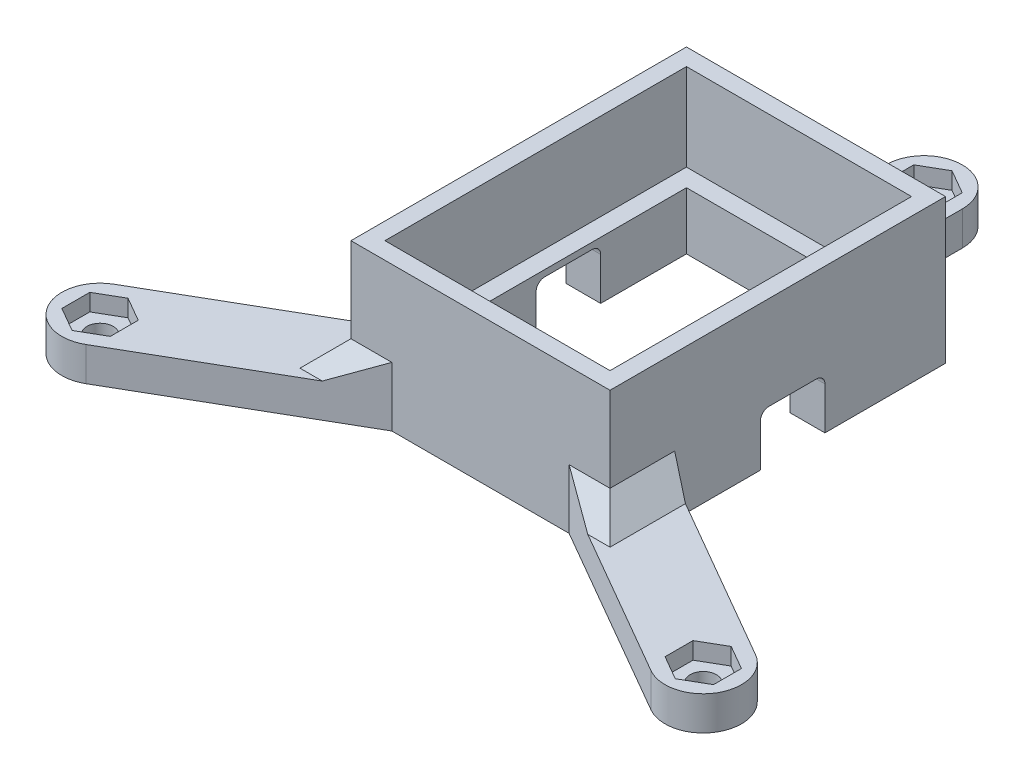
ISO-10303-21;
HEADER;
FILE_DESCRIPTION(('STEP AP214'),'2;1');
FILE_NAME('part.step','',(''),(''),'','','');
FILE_SCHEMA(('AUTOMOTIVE_DESIGN { 1 0 10303 214 1 1 1 1 }'));
ENDSEC;
DATA;
#1=APPLICATION_CONTEXT('core data for automotive mechanical design processes');
#2=APPLICATION_PROTOCOL_DEFINITION('international standard','automotive_design',2000,#1);
#3=PRODUCT_CONTEXT('',#1,'mechanical');
#4=PRODUCT('Part','Part','',(#3));
#5=PRODUCT_RELATED_PRODUCT_CATEGORY('part','',(#4));
#6=PRODUCT_DEFINITION_FORMATION('','',#4);
#7=PRODUCT_DEFINITION_CONTEXT('part definition',#1,'design');
#8=PRODUCT_DEFINITION('design','',#6,#7);
#9=PRODUCT_DEFINITION_SHAPE('','',#8);
#10=(LENGTH_UNIT() NAMED_UNIT(*) SI_UNIT(.MILLI.,.METRE.));
#11=(NAMED_UNIT(*) PLANE_ANGLE_UNIT() SI_UNIT($,.RADIAN.));
#12=(NAMED_UNIT(*) SI_UNIT($,.STERADIAN.) SOLID_ANGLE_UNIT());
#13=UNCERTAINTY_MEASURE_WITH_UNIT(LENGTH_MEASURE(1.E-05),#10,'distance_accuracy_value','');
#14=(GEOMETRIC_REPRESENTATION_CONTEXT(3) GLOBAL_UNCERTAINTY_ASSIGNED_CONTEXT((#13)) GLOBAL_UNIT_ASSIGNED_CONTEXT((#10,
#11,#12)) REPRESENTATION_CONTEXT('',''));
#15=CARTESIAN_POINT('',(0.,0.,0.));
#16=DIRECTION('',(0.,0.,1.));
#17=DIRECTION('',(1.,0.,0.));
#18=AXIS2_PLACEMENT_3D('',#15,#16,#17);
#19=CARTESIAN_POINT('',(0.,0.,0.));
#20=DIRECTION('',(0.,1.,0.));
#21=DIRECTION('',(0.,0.,1.));
#22=AXIS2_PLACEMENT_3D('',#19,#20,#21);
#23=PLANE('',#22);
#24=CARTESIAN_POINT('',(0.,0.,-32.47));
#25=DIRECTION('',(0.,1.,0.));
#26=DIRECTION('',(0.,0.,1.));
#27=AXIS2_PLACEMENT_3D('',#24,#25,#26);
#28=CIRCLE('',#27,1.55);
#29=CARTESIAN_POINT('',(0.,0.,-30.92));
#30=VERTEX_POINT('',#29);
#31=EDGE_CURVE('E785',#30,#30,#28,.T.);
#32=ORIENTED_EDGE('',*,*,#31,.T.);
#33=EDGE_LOOP('',(#32));
#34=FACE_BOUND('',#33,.T.);
#35=DIRECTION('',(0.,0.,-1.));
#36=VECTOR('',#35,1.);
#37=CARTESIAN_POINT('',(15.25,0.,19.75));
#38=LINE('',#37,#36);
#39=CARTESIAN_POINT('',(15.25,0.,-5.55));
#40=VERTEX_POINT('',#39);
#41=CARTESIAN_POINT('',(15.25,0.,-19.75));
#42=VERTEX_POINT('',#41);
#43=EDGE_CURVE('E917',#40,#42,#38,.T.);
#44=ORIENTED_EDGE('',*,*,#43,.F.);
#45=DIRECTION('',(1.,0.,0.));
#46=VECTOR('',#45,1.);
#47=CARTESIAN_POINT('',(-40.007041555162,0.,-5.55));
#48=LINE('',#47,#46);
#49=CARTESIAN_POINT('',(11.15,0.,-5.55));
#50=VERTEX_POINT('',#49);
#51=EDGE_CURVE('E431',#50,#40,#48,.T.);
#52=ORIENTED_EDGE('',*,*,#51,.F.);
#53=DIRECTION('',(0.,0.,1.));
#54=VECTOR('',#53,1.);
#55=CARTESIAN_POINT('',(11.15,0.,-15.65));
#56=LINE('',#55,#54);
#57=CARTESIAN_POINT('',(11.15,0.,-15.65));
#58=VERTEX_POINT('',#57);
#59=EDGE_CURVE('E830',#58,#50,#56,.T.);
#60=ORIENTED_EDGE('',*,*,#59,.F.);
#61=DIRECTION('',(1.,0.,0.));
#62=VECTOR('',#61,1.);
#63=CARTESIAN_POINT('',(-11.15,0.,-15.65));
#64=LINE('',#63,#62);
#65=CARTESIAN_POINT('',(-11.15,0.,-15.65));
#66=VERTEX_POINT('',#65);
#67=EDGE_CURVE('E850',#66,#58,#64,.T.);
#68=ORIENTED_EDGE('',*,*,#67,.F.);
#69=DIRECTION('',(0.,0.,-1.));
#70=VECTOR('',#69,1.);
#71=CARTESIAN_POINT('',(-11.15,0.,15.65));
#72=LINE('',#71,#70);
#73=CARTESIAN_POINT('',(-11.15,0.,-5.55));
#74=VERTEX_POINT('',#73);
#75=EDGE_CURVE('E845',#74,#66,#72,.T.);
#76=ORIENTED_EDGE('',*,*,#75,.F.);
#77=CARTESIAN_POINT('',(-15.25,0.,-5.55));
#78=VERTEX_POINT('',#77);
#79=EDGE_CURVE('E453',#78,#74,#48,.T.);
#80=ORIENTED_EDGE('',*,*,#79,.F.);
#81=DIRECTION('',(0.,0.,1.));
#82=VECTOR('',#81,1.);
#83=CARTESIAN_POINT('',(-15.25,0.,19.75));
#84=LINE('',#83,#82);
#85=CARTESIAN_POINT('',(-15.25,0.,-19.75));
#86=VERTEX_POINT('',#85);
#87=EDGE_CURVE('E943',#86,#78,#84,.T.);
#88=ORIENTED_EDGE('',*,*,#87,.F.);
#89=DIRECTION('',(-1.,0.,0.));
#90=VECTOR('',#89,1.);
#91=CARTESIAN_POINT('',(15.25,0.,-19.75));
#92=LINE('',#91,#90);
#93=CARTESIAN_POINT('',(-4.49999999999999,0.,-19.75));
#94=VERTEX_POINT('',#93);
#95=EDGE_CURVE('E937',#94,#86,#92,.T.);
#96=ORIENTED_EDGE('',*,*,#95,.F.);
#97=DIRECTION('',(0.,0.,1.));
#98=VECTOR('',#97,1.);
#99=CARTESIAN_POINT('',(-4.5,0.,0.));
#100=LINE('',#99,#98);
#101=CARTESIAN_POINT('',(-4.5,0.,-32.47));
#102=VERTEX_POINT('',#101);
#103=EDGE_CURVE('E794',#102,#94,#100,.T.);
#104=ORIENTED_EDGE('',*,*,#103,.F.);
#105=CARTESIAN_POINT('',(0.,0.,-32.47));
#106=DIRECTION('',(0.,1.,0.));
#107=DIRECTION('',(0.,0.,1.));
#108=AXIS2_PLACEMENT_3D('',#105,#106,#107);
#109=CIRCLE('',#108,4.5);
#110=CARTESIAN_POINT('',(4.5,0.,-32.47));
#111=VERTEX_POINT('',#110);
#112=EDGE_CURVE('E805',#111,#102,#109,.T.);
#113=ORIENTED_EDGE('',*,*,#112,.F.);
#114=DIRECTION('',(0.,0.,-1.));
#115=VECTOR('',#114,1.);
#116=CARTESIAN_POINT('',(4.5,0.,0.));
#117=LINE('',#116,#115);
#118=CARTESIAN_POINT('',(4.5,0.,-19.75));
#119=VERTEX_POINT('',#118);
#120=EDGE_CURVE('E789',#119,#111,#117,.T.);
#121=ORIENTED_EDGE('',*,*,#120,.F.);
#122=EDGE_CURVE('E938',#42,#119,#92,.T.);
#123=ORIENTED_EDGE('',*,*,#122,.F.);
#124=EDGE_LOOP('',(#44,#52,#60,#68,#76,#80,#88,#96,#104,#113,#121,#123));
#125=FACE_BOUND('',#124,.T.);
#126=ADVANCED_FACE('F49',(#34,#125),#23,.F.);
#127=CARTESIAN_POINT('',(0.,4.,-32.47));
#128=DIRECTION('',(0.,-1.,0.));
#129=DIRECTION('',(0.,0.,-1.));
#130=AXIS2_PLACEMENT_3D('',#127,#128,#129);
#131=CYLINDRICAL_SURFACE('',#130,1.55);
#132=ORIENTED_EDGE('',*,*,#31,.F.);
#133=EDGE_LOOP('',(#132));
#134=FACE_BOUND('',#133,.T.);
#135=CARTESIAN_POINT('',(0.,2.,-32.47));
#136=DIRECTION('',(0.,1.,0.));
#137=DIRECTION('',(0.,0.,1.));
#138=AXIS2_PLACEMENT_3D('',#135,#136,#137);
#139=CIRCLE('',#138,1.55);
#140=CARTESIAN_POINT('',(0.,2.,-30.92));
#141=VERTEX_POINT('',#140);
#142=EDGE_CURVE('E649',#141,#141,#139,.T.);
#143=ORIENTED_EDGE('',*,*,#142,.T.);
#144=EDGE_LOOP('',(#143));
#145=FACE_BOUND('',#144,.T.);
#146=ADVANCED_FACE('F1091',(#134,#145),#131,.F.);
#147=CARTESIAN_POINT('',(0.,4.,-32.47));
#148=DIRECTION('',(0.,1.,0.));
#149=DIRECTION('',(0.,0.,1.));
#150=AXIS2_PLACEMENT_3D('',#147,#148,#149);
#151=PLANE('',#150);
#152=DIRECTION('',(0.,0.,1.));
#153=VECTOR('',#152,1.);
#154=CARTESIAN_POINT('',(-4.5,4.,0.));
#155=LINE('',#154,#153);
#156=CARTESIAN_POINT('',(-4.5,4.,-32.47));
#157=VERTEX_POINT('',#156);
#158=CARTESIAN_POINT('',(-4.5,4.,-22.75));
#159=VERTEX_POINT('',#158);
#160=EDGE_CURVE('E797',#157,#159,#155,.T.);
#161=ORIENTED_EDGE('',*,*,#160,.T.);
#162=DIRECTION('',(1.,0.,0.));
#163=VECTOR('',#162,1.);
#164=CARTESIAN_POINT('',(0.,4.,-22.75));
#165=LINE('',#164,#163);
#166=CARTESIAN_POINT('',(4.5,4.,-22.75));
#167=VERTEX_POINT('',#166);
#168=EDGE_CURVE('E991',#159,#167,#165,.T.);
#169=ORIENTED_EDGE('',*,*,#168,.T.);
#170=DIRECTION('',(0.,0.,-1.));
#171=VECTOR('',#170,1.);
#172=CARTESIAN_POINT('',(4.5,4.,0.));
#173=LINE('',#172,#171);
#174=CARTESIAN_POINT('',(4.5,4.,-32.47));
#175=VERTEX_POINT('',#174);
#176=EDGE_CURVE('E790',#167,#175,#173,.T.);
#177=ORIENTED_EDGE('',*,*,#176,.T.);
#178=CARTESIAN_POINT('',(0.,4.,-32.47));
#179=DIRECTION('',(0.,1.,0.));
#180=DIRECTION('',(0.,0.,1.));
#181=AXIS2_PLACEMENT_3D('',#178,#179,#180);
#182=CIRCLE('',#181,4.5);
#183=EDGE_CURVE('E793',#175,#157,#182,.T.);
#184=ORIENTED_EDGE('',*,*,#183,.T.);
#185=EDGE_LOOP('',(#161,#169,#177,#184));
#186=FACE_BOUND('',#185,.T.);
#187=DIRECTION('',(0.,0.,-1.));
#188=VECTOR('',#187,1.);
#189=CARTESIAN_POINT('',(-2.85,4.,-30.8245517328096));
#190=LINE('',#189,#188);
#191=CARTESIAN_POINT('',(-2.85,4.,-30.8245517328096));
#192=VERTEX_POINT('',#191);
#193=CARTESIAN_POINT('',(-2.85,4.,-34.1154482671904));
#194=VERTEX_POINT('',#193);
#195=EDGE_CURVE('E539',#192,#194,#190,.T.);
#196=ORIENTED_EDGE('',*,*,#195,.T.);
#197=DIRECTION('',(0.866025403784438,0.,-0.500000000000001));
#198=VECTOR('',#197,1.);
#199=CARTESIAN_POINT('',(-2.85,4.,-34.1154482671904));
#200=LINE('',#199,#198);
#201=CARTESIAN_POINT('',(0.,4.,-35.7608965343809));
#202=VERTEX_POINT('',#201);
#203=EDGE_CURVE('E534',#194,#202,#200,.T.);
#204=ORIENTED_EDGE('',*,*,#203,.T.);
#205=DIRECTION('',(0.866025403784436,0.,0.500000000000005));
#206=VECTOR('',#205,1.);
#207=CARTESIAN_POINT('',(0.,4.,-35.7608965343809));
#208=LINE('',#207,#206);
#209=CARTESIAN_POINT('',(2.84999999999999,4.,-34.1154482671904));
#210=VERTEX_POINT('',#209);
#211=EDGE_CURVE('E530',#202,#210,#208,.T.);
#212=ORIENTED_EDGE('',*,*,#211,.T.);
#213=DIRECTION('',(0.,0.,1.));
#214=VECTOR('',#213,1.);
#215=CARTESIAN_POINT('',(2.84999999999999,4.,-34.1154482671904));
#216=LINE('',#215,#214);
#217=CARTESIAN_POINT('',(2.84999999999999,4.,-30.8245517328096));
#218=VERTEX_POINT('',#217);
#219=EDGE_CURVE('E551',#210,#218,#216,.T.);
#220=ORIENTED_EDGE('',*,*,#219,.T.);
#221=DIRECTION('',(-0.866025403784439,0.,0.5));
#222=VECTOR('',#221,1.);
#223=CARTESIAN_POINT('',(2.84999999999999,4.,-30.8245517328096));
#224=LINE('',#223,#222);
#225=CARTESIAN_POINT('',(0.,4.,-29.1791034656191));
#226=VERTEX_POINT('',#225);
#227=EDGE_CURVE('E547',#218,#226,#224,.T.);
#228=ORIENTED_EDGE('',*,*,#227,.T.);
#229=DIRECTION('',(-0.866025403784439,0.,-0.5));
#230=VECTOR('',#229,1.);
#231=CARTESIAN_POINT('',(0.,4.,-29.1791034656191));
#232=LINE('',#231,#230);
#233=EDGE_CURVE('E543',#226,#192,#232,.T.);
#234=ORIENTED_EDGE('',*,*,#233,.T.);
#235=EDGE_LOOP('',(#196,#204,#212,#220,#228,#234));
#236=FACE_BOUND('',#235,.T.);
#237=ADVANCED_FACE('F1097',(#186,#236),#151,.T.);
#238=CARTESIAN_POINT('',(35.507041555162,4.,29.0299999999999));
#239=DIRECTION('',(0.,1.,0.));
#240=DIRECTION('',(0.,0.,1.));
#241=AXIS2_PLACEMENT_3D('',#238,#239,#240);
#242=PLANE('',#241);
#243=DIRECTION('',(0.86602540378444,0.,0.499999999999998));
#244=VECTOR('',#243,1.);
#245=CARTESIAN_POINT('',(-1.44359834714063,4.,2.50038568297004));
#246=LINE('',#245,#244);
#247=CARTESIAN_POINT('',(18.25,4.,13.870489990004));
#248=VERTEX_POINT('',#247);
#249=CARTESIAN_POINT('',(37.757041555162,4.,25.13288568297));
#250=VERTEX_POINT('',#249);
#251=EDGE_CURVE('E650',#248,#250,#246,.T.);
#252=ORIENTED_EDGE('',*,*,#251,.F.);
#253=DIRECTION('',(0.,0.,1.));
#254=VECTOR('',#253,1.);
#255=CARTESIAN_POINT('',(18.25,4.,29.0299999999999));
#256=LINE('',#255,#254);
#257=CARTESIAN_POINT('',(18.25,4.,22.75));
#258=VERTEX_POINT('',#257);
#259=EDGE_CURVE('E981',#248,#258,#256,.T.);
#260=ORIENTED_EDGE('',*,*,#259,.T.);
#261=DIRECTION('',(-1.,0.,0.));
#262=VECTOR('',#261,1.);
#263=CARTESIAN_POINT('',(35.507041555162,4.,22.75));
#264=LINE('',#263,#262);
#265=CARTESIAN_POINT('',(15.6297624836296,4.,22.75));
#266=VERTEX_POINT('',#265);
#267=EDGE_CURVE('E978',#258,#266,#264,.T.);
#268=ORIENTED_EDGE('',*,*,#267,.T.);
#269=DIRECTION('',(-0.86602540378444,0.,-0.499999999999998));
#270=VECTOR('',#269,1.);
#271=CARTESIAN_POINT('',(-5.94359834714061,4.,10.29461431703));
#272=LINE('',#271,#270);
#273=CARTESIAN_POINT('',(33.257041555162,4.,32.9271143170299));
#274=VERTEX_POINT('',#273);
#275=EDGE_CURVE('E658',#274,#266,#272,.T.);
#276=ORIENTED_EDGE('',*,*,#275,.F.);
#277=CARTESIAN_POINT('',(35.507041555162,4.,29.0299999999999));
#278=DIRECTION('',(0.,1.,0.));
#279=DIRECTION('',(0.,0.,1.));
#280=AXIS2_PLACEMENT_3D('',#277,#278,#279);
#281=CIRCLE('',#280,4.49999999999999);
#282=EDGE_CURVE('E653',#274,#250,#281,.T.);
#283=ORIENTED_EDGE('',*,*,#282,.T.);
#284=EDGE_LOOP('',(#252,#260,#268,#276,#283));
#285=FACE_BOUND('',#284,.T.);
#286=DIRECTION('',(0.86602540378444,0.,0.499999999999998));
#287=VECTOR('',#286,1.);
#288=CARTESIAN_POINT('',(35.507041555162,4.,25.7391034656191));
#289=LINE('',#288,#287);
#290=CARTESIAN_POINT('',(35.507041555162,4.,25.7391034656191));
#291=VERTEX_POINT('',#290);
#292=CARTESIAN_POINT('',(38.357041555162,4.,27.3845517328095));
#293=VERTEX_POINT('',#292);
#294=EDGE_CURVE('E606',#291,#293,#289,.T.);
#295=ORIENTED_EDGE('',*,*,#294,.T.);
#296=DIRECTION('',(0.,0.,1.));
#297=VECTOR('',#296,1.);
#298=CARTESIAN_POINT('',(38.357041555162,4.,27.3845517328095));
#299=LINE('',#298,#297);
#300=CARTESIAN_POINT('',(38.357041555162,4.,30.6754482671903));
#301=VERTEX_POINT('',#300);
#302=EDGE_CURVE('E601',#293,#301,#299,.T.);
#303=ORIENTED_EDGE('',*,*,#302,.T.);
#304=DIRECTION('',(-0.866025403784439,0.,0.499999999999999));
#305=VECTOR('',#304,1.);
#306=CARTESIAN_POINT('',(38.357041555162,4.,30.6754482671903));
#307=LINE('',#306,#305);
#308=CARTESIAN_POINT('',(35.507041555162,4.,32.3208965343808));
#309=VERTEX_POINT('',#308);
#310=EDGE_CURVE('E597',#301,#309,#307,.T.);
#311=ORIENTED_EDGE('',*,*,#310,.T.);
#312=DIRECTION('',(-0.866025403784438,0.,-0.5));
#313=VECTOR('',#312,1.);
#314=CARTESIAN_POINT('',(35.507041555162,4.,32.3208965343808));
#315=LINE('',#314,#313);
#316=CARTESIAN_POINT('',(32.657041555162,4.,30.6754482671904));
#317=VERTEX_POINT('',#316);
#318=EDGE_CURVE('E618',#309,#317,#315,.T.);
#319=ORIENTED_EDGE('',*,*,#318,.T.);
#320=DIRECTION('',(0.,0.,-1.));
#321=VECTOR('',#320,1.);
#322=CARTESIAN_POINT('',(32.657041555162,4.,30.6754482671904));
#323=LINE('',#322,#321);
#324=CARTESIAN_POINT('',(32.657041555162,4.,27.3845517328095));
#325=VERTEX_POINT('',#324);
#326=EDGE_CURVE('E614',#317,#325,#323,.T.);
#327=ORIENTED_EDGE('',*,*,#326,.T.);
#328=DIRECTION('',(0.866025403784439,0.,-0.5));
#329=VECTOR('',#328,1.);
#330=CARTESIAN_POINT('',(32.657041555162,4.,27.3845517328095));
#331=LINE('',#330,#329);
#332=EDGE_CURVE('E610',#325,#291,#331,.T.);
#333=ORIENTED_EDGE('',*,*,#332,.T.);
#334=EDGE_LOOP('',(#295,#303,#311,#319,#327,#333));
#335=FACE_BOUND('',#334,.T.);
#336=ADVANCED_FACE('F1166',(#285,#335),#242,.T.);
#337=CARTESIAN_POINT('',(35.507041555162,4.,29.0299999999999));
#338=DIRECTION('',(0.,-1.,0.));
#339=DIRECTION('',(0.,0.,-1.));
#340=AXIS2_PLACEMENT_3D('',#337,#338,#339);
#341=CYLINDRICAL_SURFACE('',#340,1.54999999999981);
#342=CARTESIAN_POINT('',(35.507041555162,0.,29.0299999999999));
#343=DIRECTION('',(0.,1.,0.));
#344=DIRECTION('',(0.,0.,1.));
#345=AXIS2_PLACEMENT_3D('',#342,#343,#344);
#346=CIRCLE('',#345,1.54999999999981);
#347=CARTESIAN_POINT('',(35.507041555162,0.,30.5799999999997));
#348=VERTEX_POINT('',#347);
#349=EDGE_CURVE('E644',#348,#348,#346,.T.);
#350=ORIENTED_EDGE('',*,*,#349,.F.);
#351=EDGE_LOOP('',(#350));
#352=FACE_BOUND('',#351,.T.);
#353=CARTESIAN_POINT('',(35.507041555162,2.,29.0299999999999));
#354=DIRECTION('',(0.,1.,0.));
#355=DIRECTION('',(0.,0.,1.));
#356=AXIS2_PLACEMENT_3D('',#353,#354,#355);
#357=CIRCLE('',#356,1.54999999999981);
#358=CARTESIAN_POINT('',(35.507041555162,2.,30.5799999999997));
#359=VERTEX_POINT('',#358);
#360=EDGE_CURVE('E529',#359,#359,#357,.T.);
#361=ORIENTED_EDGE('',*,*,#360,.T.);
#362=EDGE_LOOP('',(#361));
#363=FACE_BOUND('',#362,.T.);
#364=ADVANCED_FACE('F1172',(#352,#363),#341,.F.);
#365=CARTESIAN_POINT('',(-35.507041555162,4.,29.0299999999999));
#366=DIRECTION('',(0.,-1.,0.));
#367=DIRECTION('',(0.,0.,-1.));
#368=AXIS2_PLACEMENT_3D('',#365,#366,#367);
#369=CYLINDRICAL_SURFACE('',#368,1.54999999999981);
#370=CARTESIAN_POINT('',(-35.507041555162,0.,29.0299999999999));
#371=DIRECTION('',(0.,1.,0.));
#372=DIRECTION('',(0.,0.,1.));
#373=AXIS2_PLACEMENT_3D('',#370,#371,#372);
#374=CIRCLE('',#373,1.54999999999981);
#375=CARTESIAN_POINT('',(-35.507041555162,0.,30.5799999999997));
#376=VERTEX_POINT('',#375);
#377=EDGE_CURVE('E773',#376,#376,#374,.T.);
#378=ORIENTED_EDGE('',*,*,#377,.F.);
#379=EDGE_LOOP('',(#378));
#380=FACE_BOUND('',#379,.T.);
#381=CARTESIAN_POINT('',(-35.507041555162,2.,29.0299999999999));
#382=DIRECTION('',(0.,1.,0.));
#383=DIRECTION('',(0.,0.,1.));
#384=AXIS2_PLACEMENT_3D('',#381,#382,#383);
#385=CIRCLE('',#384,1.54999999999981);
#386=CARTESIAN_POINT('',(-35.507041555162,2.,30.5799999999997));
#387=VERTEX_POINT('',#386);
#388=EDGE_CURVE('E732',#387,#387,#385,.T.);
#389=ORIENTED_EDGE('',*,*,#388,.T.);
#390=EDGE_LOOP('',(#389));
#391=FACE_BOUND('',#390,.T.);
#392=ADVANCED_FACE('F1169',(#380,#391),#369,.F.);
#393=CARTESIAN_POINT('',(15.25,17.,-19.75));
#394=DIRECTION('',(0.,0.,1.));
#395=DIRECTION('',(1.,0.,0.));
#396=AXIS2_PLACEMENT_3D('',#393,#394,#395);
#397=PLANE('',#396);
#398=DIRECTION('',(0.,-1.,0.));
#399=VECTOR('',#398,1.);
#400=CARTESIAN_POINT('',(4.5,4.,-19.75));
#401=LINE('',#400,#399);
#402=CARTESIAN_POINT('',(4.5,6.99999999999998,-19.75));
#403=VERTEX_POINT('',#402);
#404=EDGE_CURVE('E801',#403,#119,#401,.T.);
#405=ORIENTED_EDGE('',*,*,#404,.F.);
#406=DIRECTION('',(-1.,0.,0.));
#407=VECTOR('',#406,1.);
#408=CARTESIAN_POINT('',(15.25,6.99999999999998,-19.75));
#409=LINE('',#408,#407);
#410=CARTESIAN_POINT('',(-4.5,6.99999999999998,-19.75));
#411=VERTEX_POINT('',#410);
#412=EDGE_CURVE('E995',#403,#411,#409,.T.);
#413=ORIENTED_EDGE('',*,*,#412,.T.);
#414=DIRECTION('',(0.,-1.,0.));
#415=VECTOR('',#414,1.);
#416=CARTESIAN_POINT('',(-4.5,4.,-19.75));
#417=LINE('',#416,#415);
#418=EDGE_CURVE('E812',#411,#94,#417,.T.);
#419=ORIENTED_EDGE('',*,*,#418,.T.);
#420=ORIENTED_EDGE('',*,*,#95,.T.);
#421=DIRECTION('',(0.,-1.,0.));
#422=VECTOR('',#421,1.);
#423=CARTESIAN_POINT('',(-15.25,17.,-19.75));
#424=LINE('',#423,#422);
#425=CARTESIAN_POINT('',(-15.25,17.,-19.75));
#426=VERTEX_POINT('',#425);
#427=EDGE_CURVE('E957',#426,#86,#424,.T.);
#428=ORIENTED_EDGE('',*,*,#427,.F.);
#429=DIRECTION('',(-1.,0.,0.));
#430=VECTOR('',#429,1.);
#431=CARTESIAN_POINT('',(15.25,17.,-19.75));
#432=LINE('',#431,#430);
#433=CARTESIAN_POINT('',(15.25,17.,-19.75));
#434=VERTEX_POINT('',#433);
#435=EDGE_CURVE('E922',#434,#426,#432,.T.);
#436=ORIENTED_EDGE('',*,*,#435,.F.);
#437=DIRECTION('',(0.,-1.,0.));
#438=VECTOR('',#437,1.);
#439=CARTESIAN_POINT('',(15.25,17.,-19.75));
#440=LINE('',#439,#438);
#441=EDGE_CURVE('E961',#434,#42,#440,.T.);
#442=ORIENTED_EDGE('',*,*,#441,.T.);
#443=ORIENTED_EDGE('',*,*,#122,.T.);
#444=EDGE_LOOP('',(#405,#413,#419,#420,#428,#436,#442,#443));
#445=FACE_BOUND('',#444,.T.);
#446=ADVANCED_FACE('F1125',(#445),#397,.F.);
#447=CARTESIAN_POINT('',(-13.25,17.,17.75));
#448=DIRECTION('',(1.,0.,0.));
#449=DIRECTION('',(0.,0.,-1.));
#450=AXIS2_PLACEMENT_3D('',#447,#448,#449);
#451=PLANE('',#450);
#452=DIRECTION('',(0.,-1.,0.));
#453=VECTOR('',#452,1.);
#454=CARTESIAN_POINT('',(-13.25,17.,17.75));
#455=LINE('',#454,#453);
#456=CARTESIAN_POINT('',(-13.25,17.,17.75));
#457=VERTEX_POINT('',#456);
#458=CARTESIAN_POINT('',(-13.25,6.75,17.75));
#459=VERTEX_POINT('',#458);
#460=EDGE_CURVE('E913',#457,#459,#455,.T.);
#461=ORIENTED_EDGE('',*,*,#460,.T.);
#462=DIRECTION('',(0.,0.,-1.));
#463=VECTOR('',#462,1.);
#464=CARTESIAN_POINT('',(-13.25,6.75,17.75));
#465=LINE('',#464,#463);
#466=CARTESIAN_POINT('',(-13.25,6.75,-17.75));
#467=VERTEX_POINT('',#466);
#468=EDGE_CURVE('E862',#459,#467,#465,.T.);
#469=ORIENTED_EDGE('',*,*,#468,.T.);
#470=DIRECTION('',(0.,-1.,0.));
#471=VECTOR('',#470,1.);
#472=CARTESIAN_POINT('',(-13.25,17.,-17.75));
#473=LINE('',#472,#471);
#474=CARTESIAN_POINT('',(-13.25,17.,-17.75));
#475=VERTEX_POINT('',#474);
#476=EDGE_CURVE('E901',#475,#467,#473,.T.);
#477=ORIENTED_EDGE('',*,*,#476,.F.);
#478=DIRECTION('',(0.,0.,1.));
#479=VECTOR('',#478,1.);
#480=CARTESIAN_POINT('',(-13.25,17.,17.75));
#481=LINE('',#480,#479);
#482=EDGE_CURVE('E888',#475,#457,#481,.T.);
#483=ORIENTED_EDGE('',*,*,#482,.T.);
#484=EDGE_LOOP('',(#461,#469,#477,#483));
#485=FACE_BOUND('',#484,.T.);
#486=ADVANCED_FACE('F1121',(#485),#451,.T.);
#487=CARTESIAN_POINT('',(13.25,17.,17.75));
#488=DIRECTION('',(0.,0.,-1.));
#489=DIRECTION('',(-1.,0.,0.));
#490=AXIS2_PLACEMENT_3D('',#487,#488,#489);
#491=PLANE('',#490);
#492=DIRECTION('',(0.,-1.,0.));
#493=VECTOR('',#492,1.);
#494=CARTESIAN_POINT('',(13.25,17.,17.75));
#495=LINE('',#494,#493);
#496=CARTESIAN_POINT('',(13.25,17.,17.75));
#497=VERTEX_POINT('',#496);
#498=CARTESIAN_POINT('',(13.25,6.75,17.75));
#499=VERTEX_POINT('',#498);
#500=EDGE_CURVE('E909',#497,#499,#495,.T.);
#501=ORIENTED_EDGE('',*,*,#500,.T.);
#502=DIRECTION('',(-1.,0.,0.));
#503=VECTOR('',#502,1.);
#504=CARTESIAN_POINT('',(-13.25,6.75,17.75));
#505=LINE('',#504,#503);
#506=EDGE_CURVE('E884',#499,#459,#505,.T.);
#507=ORIENTED_EDGE('',*,*,#506,.T.);
#508=ORIENTED_EDGE('',*,*,#460,.F.);
#509=DIRECTION('',(1.,0.,0.));
#510=VECTOR('',#509,1.);
#511=CARTESIAN_POINT('',(13.25,17.,17.75));
#512=LINE('',#511,#510);
#513=EDGE_CURVE('E891',#457,#497,#512,.T.);
#514=ORIENTED_EDGE('',*,*,#513,.T.);
#515=EDGE_LOOP('',(#501,#507,#508,#514));
#516=FACE_BOUND('',#515,.T.);
#517=ADVANCED_FACE('F1124',(#516),#491,.T.);
#518=CARTESIAN_POINT('',(13.25,17.,17.75));
#519=DIRECTION('',(-1.,0.,0.));
#520=DIRECTION('',(0.,0.,1.));
#521=AXIS2_PLACEMENT_3D('',#518,#519,#520);
#522=PLANE('',#521);
#523=DIRECTION('',(0.,-1.,0.));
#524=VECTOR('',#523,1.);
#525=CARTESIAN_POINT('',(13.25,17.,-17.75));
#526=LINE('',#525,#524);
#527=CARTESIAN_POINT('',(13.25,17.,-17.75));
#528=VERTEX_POINT('',#527);
#529=CARTESIAN_POINT('',(13.25,6.75,-17.75));
#530=VERTEX_POINT('',#529);
#531=EDGE_CURVE('E905',#528,#530,#526,.T.);
#532=ORIENTED_EDGE('',*,*,#531,.T.);
#533=DIRECTION('',(0.,0.,1.));
#534=VECTOR('',#533,1.);
#535=CARTESIAN_POINT('',(13.25,6.75,17.75));
#536=LINE('',#535,#534);
#537=EDGE_CURVE('E880',#530,#499,#536,.T.);
#538=ORIENTED_EDGE('',*,*,#537,.T.);
#539=ORIENTED_EDGE('',*,*,#500,.F.);
#540=DIRECTION('',(0.,0.,-1.));
#541=VECTOR('',#540,1.);
#542=CARTESIAN_POINT('',(13.25,17.,17.75));
#543=LINE('',#542,#541);
#544=EDGE_CURVE('E894',#497,#528,#543,.T.);
#545=ORIENTED_EDGE('',*,*,#544,.T.);
#546=EDGE_LOOP('',(#532,#538,#539,#545));
#547=FACE_BOUND('',#546,.T.);
#548=ADVANCED_FACE('F1116',(#547),#522,.T.);
#549=CARTESIAN_POINT('',(13.25,17.,-17.75));
#550=DIRECTION('',(0.,0.,1.));
#551=DIRECTION('',(1.,0.,0.));
#552=AXIS2_PLACEMENT_3D('',#549,#550,#551);
#553=PLANE('',#552);
#554=ORIENTED_EDGE('',*,*,#476,.T.);
#555=DIRECTION('',(1.,0.,0.));
#556=VECTOR('',#555,1.);
#557=CARTESIAN_POINT('',(-13.25,6.75,-17.75));
#558=LINE('',#557,#556);
#559=EDGE_CURVE('E876',#467,#530,#558,.T.);
#560=ORIENTED_EDGE('',*,*,#559,.T.);
#561=ORIENTED_EDGE('',*,*,#531,.F.);
#562=DIRECTION('',(-1.,0.,0.));
#563=VECTOR('',#562,1.);
#564=CARTESIAN_POINT('',(13.25,17.,-17.75));
#565=LINE('',#564,#563);
#566=EDGE_CURVE('E898',#528,#475,#565,.T.);
#567=ORIENTED_EDGE('',*,*,#566,.T.);
#568=EDGE_LOOP('',(#554,#560,#561,#567));
#569=FACE_BOUND('',#568,.T.);
#570=ADVANCED_FACE('F1111',(#569),#553,.T.);
#571=CARTESIAN_POINT('',(0.,17.,0.));
#572=DIRECTION('',(0.,1.,0.));
#573=DIRECTION('',(0.,0.,1.));
#574=AXIS2_PLACEMENT_3D('',#571,#572,#573);
#575=PLANE('',#574);
#576=DIRECTION('',(0.,0.,-1.));
#577=VECTOR('',#576,1.);
#578=CARTESIAN_POINT('',(15.25,17.,19.75));
#579=LINE('',#578,#577);
#580=CARTESIAN_POINT('',(15.25,17.,19.75));
#581=VERTEX_POINT('',#580);
#582=EDGE_CURVE('E918',#581,#434,#579,.T.);
#583=ORIENTED_EDGE('',*,*,#582,.T.);
#584=ORIENTED_EDGE('',*,*,#435,.T.);
#585=DIRECTION('',(0.,0.,1.));
#586=VECTOR('',#585,1.);
#587=CARTESIAN_POINT('',(-15.25,17.,19.75));
#588=LINE('',#587,#586);
#589=CARTESIAN_POINT('',(-15.25,17.,19.75));
#590=VERTEX_POINT('',#589);
#591=EDGE_CURVE('E926',#426,#590,#588,.T.);
#592=ORIENTED_EDGE('',*,*,#591,.T.);
#593=DIRECTION('',(1.,0.,0.));
#594=VECTOR('',#593,1.);
#595=CARTESIAN_POINT('',(15.25,17.,19.75));
#596=LINE('',#595,#594);
#597=EDGE_CURVE('E929',#590,#581,#596,.T.);
#598=ORIENTED_EDGE('',*,*,#597,.T.);
#599=EDGE_LOOP('',(#583,#584,#592,#598));
#600=FACE_BOUND('',#599,.T.);
#601=ORIENTED_EDGE('',*,*,#513,.F.);
#602=ORIENTED_EDGE('',*,*,#482,.F.);
#603=ORIENTED_EDGE('',*,*,#566,.F.);
#604=ORIENTED_EDGE('',*,*,#544,.F.);
#605=EDGE_LOOP('',(#601,#602,#603,#604));
#606=FACE_BOUND('',#605,.T.);
#607=ADVANCED_FACE('F1104',(#600,#606),#575,.T.);
#608=CARTESIAN_POINT('',(-15.25,0.,2.05));
#609=VERTEX_POINT('',#608);
#610=CARTESIAN_POINT('',(-15.25,0.,12.1384391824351));
#611=VERTEX_POINT('',#610);
#612=EDGE_CURVE('E942',#609,#611,#84,.T.);
#613=ORIENTED_EDGE('',*,*,#612,.F.);
#614=DIRECTION('',(1.,0.,0.));
#615=VECTOR('',#614,1.);
#616=CARTESIAN_POINT('',(-40.007041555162,0.,2.05));
#617=LINE('',#616,#615);
#618=CARTESIAN_POINT('',(-11.15,0.,2.05));
#619=VERTEX_POINT('',#618);
#620=EDGE_CURVE('E454',#609,#619,#617,.T.);
#621=ORIENTED_EDGE('',*,*,#620,.T.);
#622=CARTESIAN_POINT('',(-11.15,0.,15.65));
#623=VERTEX_POINT('',#622);
#624=EDGE_CURVE('E846',#623,#619,#72,.T.);
#625=ORIENTED_EDGE('',*,*,#624,.F.);
#626=DIRECTION('',(-1.,0.,0.));
#627=VECTOR('',#626,1.);
#628=CARTESIAN_POINT('',(11.15,0.,15.65));
#629=LINE('',#628,#627);
#630=CARTESIAN_POINT('',(11.15,0.,15.65));
#631=VERTEX_POINT('',#630);
#632=EDGE_CURVE('E824',#631,#623,#629,.T.);
#633=ORIENTED_EDGE('',*,*,#632,.F.);
#634=CARTESIAN_POINT('',(11.15,0.,2.05));
#635=VERTEX_POINT('',#634);
#636=EDGE_CURVE('E854',#635,#631,#56,.T.);
#637=ORIENTED_EDGE('',*,*,#636,.F.);
#638=CARTESIAN_POINT('',(15.25,0.,2.05));
#639=VERTEX_POINT('',#638);
#640=EDGE_CURVE('E455',#635,#639,#617,.T.);
#641=ORIENTED_EDGE('',*,*,#640,.T.);
#642=CARTESIAN_POINT('',(15.25,0.,12.1384391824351));
#643=VERTEX_POINT('',#642);
#644=EDGE_CURVE('E933',#643,#639,#38,.T.);
#645=ORIENTED_EDGE('',*,*,#644,.F.);
#646=DIRECTION('',(0.86602540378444,0.,0.499999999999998));
#647=VECTOR('',#646,1.);
#648=CARTESIAN_POINT('',(-1.44359834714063,0.,2.50038568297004));
#649=LINE('',#648,#647);
#650=CARTESIAN_POINT('',(37.757041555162,0.,25.13288568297));
#651=VERTEX_POINT('',#650);
#652=EDGE_CURVE('E648',#643,#651,#649,.T.);
#653=ORIENTED_EDGE('',*,*,#652,.T.);
#654=CARTESIAN_POINT('',(35.507041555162,0.,29.0299999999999));
#655=DIRECTION('',(0.,1.,0.));
#656=DIRECTION('',(0.,0.,1.));
#657=AXIS2_PLACEMENT_3D('',#654,#655,#656);
#658=CIRCLE('',#657,4.49999999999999);
#659=CARTESIAN_POINT('',(33.257041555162,0.,32.9271143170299));
#660=VERTEX_POINT('',#659);
#661=EDGE_CURVE('E666',#660,#651,#658,.T.);
#662=ORIENTED_EDGE('',*,*,#661,.F.);
#663=DIRECTION('',(-0.86602540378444,0.,-0.499999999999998));
#664=VECTOR('',#663,1.);
#665=CARTESIAN_POINT('',(-5.94359834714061,0.,10.29461431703));
#666=LINE('',#665,#664);
#667=CARTESIAN_POINT('',(10.4336100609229,0.,19.75));
#668=VERTEX_POINT('',#667);
#669=EDGE_CURVE('E654',#660,#668,#666,.T.);
#670=ORIENTED_EDGE('',*,*,#669,.T.);
#671=DIRECTION('',(1.,0.,0.));
#672=VECTOR('',#671,1.);
#673=CARTESIAN_POINT('',(15.25,0.,19.75));
#674=LINE('',#673,#672);
#675=CARTESIAN_POINT('',(-10.4336100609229,0.,19.75));
#676=VERTEX_POINT('',#675);
#677=EDGE_CURVE('E923',#676,#668,#674,.T.);
#678=ORIENTED_EDGE('',*,*,#677,.F.);
#679=DIRECTION('',(0.86602540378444,0.,-0.499999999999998));
#680=VECTOR('',#679,1.);
#681=CARTESIAN_POINT('',(5.94359834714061,0.,10.29461431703));
#682=LINE('',#681,#680);
#683=CARTESIAN_POINT('',(-33.257041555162,0.,32.9271143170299));
#684=VERTEX_POINT('',#683);
#685=EDGE_CURVE('E762',#684,#676,#682,.T.);
#686=ORIENTED_EDGE('',*,*,#685,.F.);
#687=CARTESIAN_POINT('',(-35.507041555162,0.,29.0299999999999));
#688=DIRECTION('',(0.,1.,0.));
#689=DIRECTION('',(0.,0.,1.));
#690=AXIS2_PLACEMENT_3D('',#687,#688,#689);
#691=CIRCLE('',#690,4.49999999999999);
#692=CARTESIAN_POINT('',(-37.757041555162,0.,25.1328856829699));
#693=VERTEX_POINT('',#692);
#694=EDGE_CURVE('E766',#693,#684,#691,.T.);
#695=ORIENTED_EDGE('',*,*,#694,.F.);
#696=DIRECTION('',(-0.86602540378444,0.,0.499999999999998));
#697=VECTOR('',#696,1.);
#698=CARTESIAN_POINT('',(1.44359834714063,0.,2.50038568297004));
#699=LINE('',#698,#697);
#700=EDGE_CURVE('E770',#611,#693,#699,.T.);
#701=ORIENTED_EDGE('',*,*,#700,.F.);
#702=EDGE_LOOP('',(#613,#621,#625,#633,#637,#641,#645,#653,#662,#670,#678,#686,#695,#701));
#703=FACE_BOUND('',#702,.T.);
#704=ORIENTED_EDGE('',*,*,#377,.T.);
#705=EDGE_LOOP('',(#704));
#706=FACE_BOUND('',#705,.T.);
#707=ORIENTED_EDGE('',*,*,#349,.T.);
#708=EDGE_LOOP('',(#707));
#709=FACE_BOUND('',#708,.T.);
#710=ADVANCED_FACE('F1059',(#703,#706,#709),#23,.F.);
#711=CARTESIAN_POINT('',(15.25,17.,19.75));
#712=DIRECTION('',(-1.,0.,0.));
#713=DIRECTION('',(0.,0.,1.));
#714=AXIS2_PLACEMENT_3D('',#711,#712,#713);
#715=PLANE('',#714);
#716=CARTESIAN_POINT('',(15.25,5.,-4.55));
#717=DIRECTION('',(1.,0.,0.));
#718=DIRECTION('',(0.,0.,-1.));
#719=AXIS2_PLACEMENT_3D('',#716,#717,#718);
#720=CIRCLE('',#719,1.);
#721=CARTESIAN_POINT('',(15.25,5.,-5.55));
#722=VERTEX_POINT('',#721);
#723=CARTESIAN_POINT('',(15.25,6.,-4.55));
#724=VERTEX_POINT('',#723);
#725=EDGE_CURVE('E418',#722,#724,#720,.T.);
#726=ORIENTED_EDGE('',*,*,#725,.F.);
#727=DIRECTION('',(0.,1.,0.));
#728=VECTOR('',#727,1.);
#729=CARTESIAN_POINT('',(15.25,0.,-5.55));
#730=LINE('',#729,#728);
#731=EDGE_CURVE('E428',#40,#722,#730,.T.);
#732=ORIENTED_EDGE('',*,*,#731,.F.);
#733=ORIENTED_EDGE('',*,*,#43,.T.);
#734=ORIENTED_EDGE('',*,*,#441,.F.);
#735=ORIENTED_EDGE('',*,*,#582,.F.);
#736=DIRECTION('',(0.,-1.,0.));
#737=VECTOR('',#736,1.);
#738=CARTESIAN_POINT('',(15.25,17.,19.75));
#739=LINE('',#738,#737);
#740=CARTESIAN_POINT('',(15.25,7.00000000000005,19.75));
#741=VERTEX_POINT('',#740);
#742=EDGE_CURVE('E932',#581,#741,#739,.T.);
#743=ORIENTED_EDGE('',*,*,#742,.T.);
#744=DIRECTION('',(0.,0.,-1.));
#745=VECTOR('',#744,1.);
#746=CARTESIAN_POINT('',(15.25,7.00000000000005,19.75));
#747=LINE('',#746,#745);
#748=CARTESIAN_POINT('',(15.25,7.00000000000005,12.1384391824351));
#749=VERTEX_POINT('',#748);
#750=EDGE_CURVE('E965',#741,#749,#747,.T.);
#751=ORIENTED_EDGE('',*,*,#750,.T.);
#752=DIRECTION('',(0.,-1.,0.));
#753=VECTOR('',#752,1.);
#754=CARTESIAN_POINT('',(15.25,4.,12.1384391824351));
#755=LINE('',#754,#753);
#756=EDGE_CURVE('E662',#749,#643,#755,.T.);
#757=ORIENTED_EDGE('',*,*,#756,.T.);
#758=ORIENTED_EDGE('',*,*,#644,.T.);
#759=DIRECTION('',(0.,-1.,0.));
#760=VECTOR('',#759,1.);
#761=CARTESIAN_POINT('',(15.25,0.,2.05));
#762=LINE('',#761,#760);
#763=CARTESIAN_POINT('',(15.25,5.,2.05));
#764=VERTEX_POINT('',#763);
#765=EDGE_CURVE('E425',#764,#639,#762,.T.);
#766=ORIENTED_EDGE('',*,*,#765,.F.);
#767=CARTESIAN_POINT('',(15.25,5.,1.05));
#768=DIRECTION('',(1.,0.,0.));
#769=DIRECTION('',(0.,0.,-1.));
#770=AXIS2_PLACEMENT_3D('',#767,#768,#769);
#771=CIRCLE('',#770,1.);
#772=CARTESIAN_POINT('',(15.25,6.,1.05));
#773=VERTEX_POINT('',#772);
#774=EDGE_CURVE('E443',#773,#764,#771,.T.);
#775=ORIENTED_EDGE('',*,*,#774,.F.);
#776=DIRECTION('',(0.,0.,1.));
#777=VECTOR('',#776,1.);
#778=CARTESIAN_POINT('',(15.25,6.,-4.55));
#779=LINE('',#778,#777);
#780=EDGE_CURVE('E439',#724,#773,#779,.T.);
#781=ORIENTED_EDGE('',*,*,#780,.F.);
#782=EDGE_LOOP('',(#726,#732,#733,#734,#735,#743,#751,#757,#758,#766,#775,#781));
#783=FACE_BOUND('',#782,.T.);
#784=ADVANCED_FACE('F436',(#783),#715,.F.);
#785=CARTESIAN_POINT('',(-15.25,17.,19.75));
#786=DIRECTION('',(1.,0.,0.));
#787=DIRECTION('',(0.,0.,-1.));
#788=AXIS2_PLACEMENT_3D('',#785,#786,#787);
#789=PLANE('',#788);
#790=ORIENTED_EDGE('',*,*,#87,.T.);
#791=DIRECTION('',(0.,1.,0.));
#792=VECTOR('',#791,1.);
#793=CARTESIAN_POINT('',(-15.25,17.,-5.55));
#794=LINE('',#793,#792);
#795=CARTESIAN_POINT('',(-15.25,5.,-5.55));
#796=VERTEX_POINT('',#795);
#797=EDGE_CURVE('E503',#78,#796,#794,.T.);
#798=ORIENTED_EDGE('',*,*,#797,.T.);
#799=CARTESIAN_POINT('',(-15.25,5.,-4.55));
#800=DIRECTION('',(1.,0.,0.));
#801=DIRECTION('',(0.,0.,-1.));
#802=AXIS2_PLACEMENT_3D('',#799,#800,#801);
#803=CIRCLE('',#802,1.);
#804=CARTESIAN_POINT('',(-15.25,6.,-4.55));
#805=VERTEX_POINT('',#804);
#806=EDGE_CURVE('E472',#796,#805,#803,.T.);
#807=ORIENTED_EDGE('',*,*,#806,.T.);
#808=DIRECTION('',(0.,0.,1.));
#809=VECTOR('',#808,1.);
#810=CARTESIAN_POINT('',(-15.25,6.,19.75));
#811=LINE('',#810,#809);
#812=CARTESIAN_POINT('',(-15.25,6.,1.05));
#813=VERTEX_POINT('',#812);
#814=EDGE_CURVE('E480',#805,#813,#811,.T.);
#815=ORIENTED_EDGE('',*,*,#814,.T.);
#816=CARTESIAN_POINT('',(-15.25,5.,1.05));
#817=DIRECTION('',(1.,0.,0.));
#818=DIRECTION('',(0.,0.,-1.));
#819=AXIS2_PLACEMENT_3D('',#816,#817,#818);
#820=CIRCLE('',#819,1.);
#821=CARTESIAN_POINT('',(-15.25,5.,2.05));
#822=VERTEX_POINT('',#821);
#823=EDGE_CURVE('E488',#813,#822,#820,.T.);
#824=ORIENTED_EDGE('',*,*,#823,.T.);
#825=DIRECTION('',(0.,-1.,0.));
#826=VECTOR('',#825,1.);
#827=CARTESIAN_POINT('',(-15.25,17.,2.05000000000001));
#828=LINE('',#827,#826);
#829=EDGE_CURVE('E496',#822,#609,#828,.T.);
#830=ORIENTED_EDGE('',*,*,#829,.T.);
#831=ORIENTED_EDGE('',*,*,#612,.T.);
#832=DIRECTION('',(0.,-1.,0.));
#833=VECTOR('',#832,1.);
#834=CARTESIAN_POINT('',(-15.25,4.,12.1384391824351));
#835=LINE('',#834,#833);
#836=CARTESIAN_POINT('',(-15.25,7.00000000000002,12.1384391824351));
#837=VERTEX_POINT('',#836);
#838=EDGE_CURVE('E746',#837,#611,#835,.T.);
#839=ORIENTED_EDGE('',*,*,#838,.F.);
#840=DIRECTION('',(0.,0.,1.));
#841=VECTOR('',#840,1.);
#842=CARTESIAN_POINT('',(-15.25,7.00000000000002,19.75));
#843=LINE('',#842,#841);
#844=CARTESIAN_POINT('',(-15.25,7.00000000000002,19.75));
#845=VERTEX_POINT('',#844);
#846=EDGE_CURVE('E1006',#837,#845,#843,.T.);
#847=ORIENTED_EDGE('',*,*,#846,.T.);
#848=DIRECTION('',(0.,-1.,0.));
#849=VECTOR('',#848,1.);
#850=CARTESIAN_POINT('',(-15.25,17.,19.75));
#851=LINE('',#850,#849);
#852=EDGE_CURVE('E953',#590,#845,#851,.T.);
#853=ORIENTED_EDGE('',*,*,#852,.F.);
#854=ORIENTED_EDGE('',*,*,#591,.F.);
#855=ORIENTED_EDGE('',*,*,#427,.T.);
#856=EDGE_LOOP('',(#790,#798,#807,#815,#824,#830,#831,#839,#847,#853,#854,#855));
#857=FACE_BOUND('',#856,.T.);
#858=ADVANCED_FACE('F1109',(#857),#789,.F.);
#859=CARTESIAN_POINT('',(15.25,17.,19.75));
#860=DIRECTION('',(0.,0.,-1.));
#861=DIRECTION('',(-1.,0.,0.));
#862=AXIS2_PLACEMENT_3D('',#859,#860,#861);
#863=PLANE('',#862);
#864=DIRECTION('',(0.,-1.,0.));
#865=VECTOR('',#864,1.);
#866=CARTESIAN_POINT('',(10.4336100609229,4.,19.75));
#867=LINE('',#866,#865);
#868=CARTESIAN_POINT('',(10.4336100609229,7.00000000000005,19.75));
#869=VERTEX_POINT('',#868);
#870=EDGE_CURVE('E673',#869,#668,#867,.T.);
#871=ORIENTED_EDGE('',*,*,#870,.F.);
#872=DIRECTION('',(1.,0.,0.));
#873=VECTOR('',#872,1.);
#874=CARTESIAN_POINT('',(15.25,7.00000000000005,19.75));
#875=LINE('',#874,#873);
#876=EDGE_CURVE('E988',#869,#741,#875,.T.);
#877=ORIENTED_EDGE('',*,*,#876,.T.);
#878=ORIENTED_EDGE('',*,*,#742,.F.);
#879=ORIENTED_EDGE('',*,*,#597,.F.);
#880=ORIENTED_EDGE('',*,*,#852,.T.);
#881=DIRECTION('',(1.,0.,0.));
#882=VECTOR('',#881,1.);
#883=CARTESIAN_POINT('',(15.25,7.00000000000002,19.75));
#884=LINE('',#883,#882);
#885=CARTESIAN_POINT('',(-10.4336100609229,7.00000000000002,19.75));
#886=VERTEX_POINT('',#885);
#887=EDGE_CURVE('E984',#845,#886,#884,.T.);
#888=ORIENTED_EDGE('',*,*,#887,.T.);
#889=DIRECTION('',(0.,-1.,0.));
#890=VECTOR('',#889,1.);
#891=CARTESIAN_POINT('',(-10.4336100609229,4.,19.75));
#892=LINE('',#891,#890);
#893=EDGE_CURVE('E758',#886,#676,#892,.T.);
#894=ORIENTED_EDGE('',*,*,#893,.T.);
#895=ORIENTED_EDGE('',*,*,#677,.T.);
#896=EDGE_LOOP('',(#871,#877,#878,#879,#880,#888,#894,#895));
#897=FACE_BOUND('',#896,.T.);
#898=ADVANCED_FACE('F1137',(#897),#863,.F.);
#899=CARTESIAN_POINT('',(0.,6.75,0.));
#900=DIRECTION('',(0.,-1.,0.));
#901=DIRECTION('',(0.,0.,-1.));
#902=AXIS2_PLACEMENT_3D('',#899,#900,#901);
#903=PLANE('',#902);
#904=DIRECTION('',(0.,0.,1.));
#905=VECTOR('',#904,1.);
#906=CARTESIAN_POINT('',(11.15,6.75,-15.65));
#907=LINE('',#906,#905);
#908=CARTESIAN_POINT('',(11.15,6.75,-15.65));
#909=VERTEX_POINT('',#908);
#910=CARTESIAN_POINT('',(11.15,6.75,15.65));
#911=VERTEX_POINT('',#910);
#912=EDGE_CURVE('E838',#909,#911,#907,.T.);
#913=ORIENTED_EDGE('',*,*,#912,.T.);
#914=DIRECTION('',(-1.,0.,0.));
#915=VECTOR('',#914,1.);
#916=CARTESIAN_POINT('',(11.15,6.75,15.65));
#917=LINE('',#916,#915);
#918=CARTESIAN_POINT('',(-11.15,6.75,15.65));
#919=VERTEX_POINT('',#918);
#920=EDGE_CURVE('E825',#911,#919,#917,.T.);
#921=ORIENTED_EDGE('',*,*,#920,.T.);
#922=DIRECTION('',(0.,0.,-1.));
#923=VECTOR('',#922,1.);
#924=CARTESIAN_POINT('',(-11.15,6.75,15.65));
#925=LINE('',#924,#923);
#926=CARTESIAN_POINT('',(-11.15,6.75,-15.65));
#927=VERTEX_POINT('',#926);
#928=EDGE_CURVE('E829',#919,#927,#925,.T.);
#929=ORIENTED_EDGE('',*,*,#928,.T.);
#930=DIRECTION('',(1.,0.,0.));
#931=VECTOR('',#930,1.);
#932=CARTESIAN_POINT('',(-11.15,6.75,-15.65));
#933=LINE('',#932,#931);
#934=EDGE_CURVE('E834',#927,#909,#933,.T.);
#935=ORIENTED_EDGE('',*,*,#934,.T.);
#936=EDGE_LOOP('',(#913,#921,#929,#935));
#937=FACE_BOUND('',#936,.T.);
#938=ORIENTED_EDGE('',*,*,#468,.F.);
#939=ORIENTED_EDGE('',*,*,#506,.F.);
#940=ORIENTED_EDGE('',*,*,#537,.F.);
#941=ORIENTED_EDGE('',*,*,#559,.F.);
#942=EDGE_LOOP('',(#938,#939,#940,#941));
#943=FACE_BOUND('',#942,.T.);
#944=ADVANCED_FACE('F1133',(#937,#943),#903,.F.);
#945=CARTESIAN_POINT('',(11.15,6.75,15.65));
#946=DIRECTION('',(0.,0.,1.));
#947=DIRECTION('',(1.,0.,0.));
#948=AXIS2_PLACEMENT_3D('',#945,#946,#947);
#949=PLANE('',#948);
#950=ORIENTED_EDGE('',*,*,#632,.T.);
#951=DIRECTION('',(0.,-1.,0.));
#952=VECTOR('',#951,1.);
#953=CARTESIAN_POINT('',(-11.15,6.75,15.65));
#954=LINE('',#953,#952);
#955=EDGE_CURVE('E842',#919,#623,#954,.T.);
#956=ORIENTED_EDGE('',*,*,#955,.F.);
#957=ORIENTED_EDGE('',*,*,#920,.F.);
#958=DIRECTION('',(0.,-1.,0.));
#959=VECTOR('',#958,1.);
#960=CARTESIAN_POINT('',(11.15,6.75,15.65));
#961=LINE('',#960,#959);
#962=EDGE_CURVE('E858',#911,#631,#961,.T.);
#963=ORIENTED_EDGE('',*,*,#962,.T.);
#964=EDGE_LOOP('',(#950,#956,#957,#963));
#965=FACE_BOUND('',#964,.T.);
#966=ADVANCED_FACE('F1136',(#965),#949,.F.);
#967=CARTESIAN_POINT('',(11.15,6.75,-15.65));
#968=DIRECTION('',(1.,0.,0.));
#969=DIRECTION('',(0.,0.,-1.));
#970=AXIS2_PLACEMENT_3D('',#967,#968,#969);
#971=PLANE('',#970);
#972=ORIENTED_EDGE('',*,*,#59,.T.);
#973=DIRECTION('',(0.,1.,0.));
#974=VECTOR('',#973,1.);
#975=CARTESIAN_POINT('',(11.15,6.75,-5.55));
#976=LINE('',#975,#974);
#977=CARTESIAN_POINT('',(11.15,5.,-5.55));
#978=VERTEX_POINT('',#977);
#979=EDGE_CURVE('E500',#50,#978,#976,.T.);
#980=ORIENTED_EDGE('',*,*,#979,.T.);
#981=CARTESIAN_POINT('',(11.15,5.,-4.55));
#982=DIRECTION('',(1.,0.,0.));
#983=DIRECTION('',(0.,0.,-1.));
#984=AXIS2_PLACEMENT_3D('',#981,#982,#983);
#985=CIRCLE('',#984,1.);
#986=CARTESIAN_POINT('',(11.15,6.,-4.55));
#987=VERTEX_POINT('',#986);
#988=EDGE_CURVE('E421',#978,#987,#985,.T.);
#989=ORIENTED_EDGE('',*,*,#988,.T.);
#990=DIRECTION('',(0.,0.,1.));
#991=VECTOR('',#990,1.);
#992=CARTESIAN_POINT('',(11.15,6.,-15.65));
#993=LINE('',#992,#991);
#994=CARTESIAN_POINT('',(11.15,6.,1.05));
#995=VERTEX_POINT('',#994);
#996=EDGE_CURVE('E476',#987,#995,#993,.T.);
#997=ORIENTED_EDGE('',*,*,#996,.T.);
#998=CARTESIAN_POINT('',(11.15,5.,1.05));
#999=DIRECTION('',(1.,0.,0.));
#1000=DIRECTION('',(0.,0.,-1.));
#1001=AXIS2_PLACEMENT_3D('',#998,#999,#1000);
#1002=CIRCLE('',#1001,1.);
#1003=CARTESIAN_POINT('',(11.15,5.,2.05));
#1004=VERTEX_POINT('',#1003);
#1005=EDGE_CURVE('E484',#995,#1004,#1002,.T.);
#1006=ORIENTED_EDGE('',*,*,#1005,.T.);
#1007=DIRECTION('',(0.,-1.,0.));
#1008=VECTOR('',#1007,1.);
#1009=CARTESIAN_POINT('',(11.15,6.74999999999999,2.05000000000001));
#1010=LINE('',#1009,#1008);
#1011=EDGE_CURVE('E492',#1004,#635,#1010,.T.);
#1012=ORIENTED_EDGE('',*,*,#1011,.T.);
#1013=ORIENTED_EDGE('',*,*,#636,.T.);
#1014=ORIENTED_EDGE('',*,*,#962,.F.);
#1015=ORIENTED_EDGE('',*,*,#912,.F.);
#1016=DIRECTION('',(0.,-1.,0.));
#1017=VECTOR('',#1016,1.);
#1018=CARTESIAN_POINT('',(11.15,6.75,-15.65));
#1019=LINE('',#1018,#1017);
#1020=EDGE_CURVE('E863',#909,#58,#1019,.T.);
#1021=ORIENTED_EDGE('',*,*,#1020,.T.);
#1022=EDGE_LOOP('',(#972,#980,#989,#997,#1006,#1012,#1013,#1014,#1015,#1021));
#1023=FACE_BOUND('',#1022,.T.);
#1024=ADVANCED_FACE('F1141',(#1023),#971,.F.);
#1025=CARTESIAN_POINT('',(-11.15,6.75,-15.65));
#1026=DIRECTION('',(0.,0.,-1.));
#1027=DIRECTION('',(-1.,0.,0.));
#1028=AXIS2_PLACEMENT_3D('',#1025,#1026,#1027);
#1029=PLANE('',#1028);
#1030=ORIENTED_EDGE('',*,*,#67,.T.);
#1031=ORIENTED_EDGE('',*,*,#1020,.F.);
#1032=ORIENTED_EDGE('',*,*,#934,.F.);
#1033=DIRECTION('',(0.,-1.,0.));
#1034=VECTOR('',#1033,1.);
#1035=CARTESIAN_POINT('',(-11.15,6.75,-15.65));
#1036=LINE('',#1035,#1034);
#1037=EDGE_CURVE('E866',#927,#66,#1036,.T.);
#1038=ORIENTED_EDGE('',*,*,#1037,.T.);
#1039=EDGE_LOOP('',(#1030,#1031,#1032,#1038));
#1040=FACE_BOUND('',#1039,.T.);
#1041=ADVANCED_FACE('F1146',(#1040),#1029,.F.);
#1042=CARTESIAN_POINT('',(-11.15,6.75,15.65));
#1043=DIRECTION('',(-1.,0.,0.));
#1044=DIRECTION('',(0.,0.,1.));
#1045=AXIS2_PLACEMENT_3D('',#1042,#1043,#1044);
#1046=PLANE('',#1045);
#1047=CARTESIAN_POINT('',(-11.15,5.,-4.55));
#1048=DIRECTION('',(-1.,0.,0.));
#1049=DIRECTION('',(0.,0.,1.));
#1050=AXIS2_PLACEMENT_3D('',#1047,#1048,#1049);
#1051=CIRCLE('',#1050,1.);
#1052=CARTESIAN_POINT('',(-11.15,6.,-4.55));
#1053=VERTEX_POINT('',#1052);
#1054=CARTESIAN_POINT('',(-11.15,5.,-5.55));
#1055=VERTEX_POINT('',#1054);
#1056=EDGE_CURVE('E1030',#1053,#1055,#1051,.T.);
#1057=ORIENTED_EDGE('',*,*,#1056,.T.);
#1058=DIRECTION('',(0.,-1.,0.));
#1059=VECTOR('',#1058,1.);
#1060=CARTESIAN_POINT('',(-11.15,6.75,-5.55));
#1061=LINE('',#1060,#1059);
#1062=EDGE_CURVE('E12',#1055,#74,#1061,.T.);
#1063=ORIENTED_EDGE('',*,*,#1062,.T.);
#1064=ORIENTED_EDGE('',*,*,#75,.T.);
#1065=ORIENTED_EDGE('',*,*,#1037,.F.);
#1066=ORIENTED_EDGE('',*,*,#928,.F.);
#1067=ORIENTED_EDGE('',*,*,#955,.T.);
#1068=ORIENTED_EDGE('',*,*,#624,.T.);
#1069=DIRECTION('',(0.,1.,0.));
#1070=VECTOR('',#1069,1.);
#1071=CARTESIAN_POINT('',(-11.15,6.75,2.05));
#1072=LINE('',#1071,#1070);
#1073=CARTESIAN_POINT('',(-11.15,5.,2.05));
#1074=VERTEX_POINT('',#1073);
#1075=EDGE_CURVE('E59',#619,#1074,#1072,.T.);
#1076=ORIENTED_EDGE('',*,*,#1075,.T.);
#1077=CARTESIAN_POINT('',(-11.15,5.,1.05));
#1078=DIRECTION('',(-1.,0.,0.));
#1079=DIRECTION('',(0.,0.,1.));
#1080=AXIS2_PLACEMENT_3D('',#1077,#1078,#1079);
#1081=CIRCLE('',#1080,1.);
#1082=CARTESIAN_POINT('',(-11.15,6.,1.05));
#1083=VERTEX_POINT('',#1082);
#1084=EDGE_CURVE('E1044',#1074,#1083,#1081,.T.);
#1085=ORIENTED_EDGE('',*,*,#1084,.T.);
#1086=DIRECTION('',(0.,0.,-1.));
#1087=VECTOR('',#1086,1.);
#1088=CARTESIAN_POINT('',(-11.15,6.,15.65));
#1089=LINE('',#1088,#1087);
#1090=EDGE_CURVE('E1040',#1083,#1053,#1089,.T.);
#1091=ORIENTED_EDGE('',*,*,#1090,.T.);
#1092=EDGE_LOOP('',(#1057,#1063,#1064,#1065,#1066,#1067,#1068,#1076,#1085,#1091));
#1093=FACE_BOUND('',#1092,.T.);
#1094=ADVANCED_FACE('F1050',(#1093),#1046,.F.);
#1095=CARTESIAN_POINT('',(4.5,4.,0.));
#1096=DIRECTION('',(-1.,0.,0.));
#1097=DIRECTION('',(0.,0.,1.));
#1098=AXIS2_PLACEMENT_3D('',#1095,#1096,#1097);
#1099=PLANE('',#1098);
#1100=ORIENTED_EDGE('',*,*,#120,.T.);
#1101=DIRECTION('',(0.,-1.,0.));
#1102=VECTOR('',#1101,1.);
#1103=CARTESIAN_POINT('',(4.5,4.,-32.47));
#1104=LINE('',#1103,#1102);
#1105=EDGE_CURVE('E820',#175,#111,#1104,.T.);
#1106=ORIENTED_EDGE('',*,*,#1105,.F.);
#1107=ORIENTED_EDGE('',*,*,#176,.F.);
#1108=DIRECTION('',(0.,0.707106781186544,0.707106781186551));
#1109=VECTOR('',#1108,1.);
#1110=CARTESIAN_POINT('',(4.5,15.375,-11.3749999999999));
#1111=LINE('',#1110,#1109);
#1112=EDGE_CURVE('E1016',#167,#403,#1111,.T.);
#1113=ORIENTED_EDGE('',*,*,#1112,.T.);
#1114=ORIENTED_EDGE('',*,*,#404,.T.);
#1115=EDGE_LOOP('',(#1100,#1106,#1107,#1113,#1114));
#1116=FACE_BOUND('',#1115,.T.);
#1117=ADVANCED_FACE('F1145',(#1116),#1099,.F.);
#1118=CARTESIAN_POINT('',(0.,4.,-32.47));
#1119=DIRECTION('',(0.,-1.,0.));
#1120=DIRECTION('',(0.,0.,-1.));
#1121=AXIS2_PLACEMENT_3D('',#1118,#1119,#1120);
#1122=CYLINDRICAL_SURFACE('',#1121,4.5);
#1123=ORIENTED_EDGE('',*,*,#112,.T.);
#1124=DIRECTION('',(0.,-1.,0.));
#1125=VECTOR('',#1124,1.);
#1126=CARTESIAN_POINT('',(-4.5,4.,-32.47));
#1127=LINE('',#1126,#1125);
#1128=EDGE_CURVE('E816',#157,#102,#1127,.T.);
#1129=ORIENTED_EDGE('',*,*,#1128,.F.);
#1130=ORIENTED_EDGE('',*,*,#183,.F.);
#1131=ORIENTED_EDGE('',*,*,#1105,.T.);
#1132=EDGE_LOOP('',(#1123,#1129,#1130,#1131));
#1133=FACE_BOUND('',#1132,.T.);
#1134=ADVANCED_FACE('F1155',(#1133),#1122,.T.);
#1135=CARTESIAN_POINT('',(-4.5,4.,0.));
#1136=DIRECTION('',(1.,0.,0.));
#1137=DIRECTION('',(0.,0.,-1.));
#1138=AXIS2_PLACEMENT_3D('',#1135,#1136,#1137);
#1139=PLANE('',#1138);
#1140=ORIENTED_EDGE('',*,*,#103,.T.);
#1141=ORIENTED_EDGE('',*,*,#418,.F.);
#1142=DIRECTION('',(0.,-0.707106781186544,-0.707106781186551));
#1143=VECTOR('',#1142,1.);
#1144=CARTESIAN_POINT('',(-4.5,15.375,-11.3749999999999));
#1145=LINE('',#1144,#1143);
#1146=EDGE_CURVE('E1020',#411,#159,#1145,.T.);
#1147=ORIENTED_EDGE('',*,*,#1146,.T.);
#1148=ORIENTED_EDGE('',*,*,#160,.F.);
#1149=ORIENTED_EDGE('',*,*,#1128,.T.);
#1150=EDGE_LOOP('',(#1140,#1141,#1147,#1148,#1149));
#1151=FACE_BOUND('',#1150,.T.);
#1152=ADVANCED_FACE('F1159',(#1151),#1139,.F.);
#1153=CARTESIAN_POINT('',(-35.507041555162,4.,29.0299999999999));
#1154=DIRECTION('',(0.,1.,0.));
#1155=DIRECTION('',(0.,0.,1.));
#1156=AXIS2_PLACEMENT_3D('',#1153,#1154,#1155);
#1157=PLANE('',#1156);
#1158=DIRECTION('',(0.866025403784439,0.,0.499999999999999));
#1159=VECTOR('',#1158,1.);
#1160=CARTESIAN_POINT('',(-38.357041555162,4.,30.6754482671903));
#1161=LINE('',#1160,#1159);
#1162=CARTESIAN_POINT('',(-38.357041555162,4.,30.6754482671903));
#1163=VERTEX_POINT('',#1162);
#1164=CARTESIAN_POINT('',(-35.507041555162,4.,32.3208965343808));
#1165=VERTEX_POINT('',#1164);
#1166=EDGE_CURVE('E729',#1163,#1165,#1161,.T.);
#1167=ORIENTED_EDGE('',*,*,#1166,.F.);
#1168=DIRECTION('',(0.,0.,1.));
#1169=VECTOR('',#1168,1.);
#1170=CARTESIAN_POINT('',(-38.357041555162,4.,27.3845517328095));
#1171=LINE('',#1170,#1169);
#1172=CARTESIAN_POINT('',(-38.357041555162,4.,27.3845517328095));
#1173=VERTEX_POINT('',#1172);
#1174=EDGE_CURVE('E693',#1173,#1163,#1171,.T.);
#1175=ORIENTED_EDGE('',*,*,#1174,.F.);
#1176=DIRECTION('',(-0.86602540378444,0.,0.499999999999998));
#1177=VECTOR('',#1176,1.);
#1178=CARTESIAN_POINT('',(-35.507041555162,4.,25.7391034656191));
#1179=LINE('',#1178,#1177);
#1180=CARTESIAN_POINT('',(-35.507041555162,4.,25.7391034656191));
#1181=VERTEX_POINT('',#1180);
#1182=EDGE_CURVE('E713',#1181,#1173,#1179,.T.);
#1183=ORIENTED_EDGE('',*,*,#1182,.F.);
#1184=DIRECTION('',(-0.866025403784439,0.,-0.5));
#1185=VECTOR('',#1184,1.);
#1186=CARTESIAN_POINT('',(-32.657041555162,4.,27.3845517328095));
#1187=LINE('',#1186,#1185);
#1188=CARTESIAN_POINT('',(-32.657041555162,4.,27.3845517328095));
#1189=VERTEX_POINT('',#1188);
#1190=EDGE_CURVE('E717',#1189,#1181,#1187,.T.);
#1191=ORIENTED_EDGE('',*,*,#1190,.F.);
#1192=DIRECTION('',(0.,0.,-1.));
#1193=VECTOR('',#1192,1.);
#1194=CARTESIAN_POINT('',(-32.657041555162,4.,30.6754482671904));
#1195=LINE('',#1194,#1193);
#1196=CARTESIAN_POINT('',(-32.657041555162,4.,30.6754482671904));
#1197=VERTEX_POINT('',#1196);
#1198=EDGE_CURVE('E721',#1197,#1189,#1195,.T.);
#1199=ORIENTED_EDGE('',*,*,#1198,.F.);
#1200=DIRECTION('',(0.866025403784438,0.,-0.5));
#1201=VECTOR('',#1200,1.);
#1202=CARTESIAN_POINT('',(-35.507041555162,4.,32.3208965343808));
#1203=LINE('',#1202,#1201);
#1204=EDGE_CURVE('E725',#1165,#1197,#1203,.T.);
#1205=ORIENTED_EDGE('',*,*,#1204,.F.);
#1206=EDGE_LOOP('',(#1167,#1175,#1183,#1191,#1199,#1205));
#1207=FACE_BOUND('',#1206,.T.);
#1208=DIRECTION('',(-1.,0.,0.));
#1209=VECTOR('',#1208,1.);
#1210=CARTESIAN_POINT('',(-35.507041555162,4.,22.7500000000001));
#1211=LINE('',#1210,#1209);
#1212=CARTESIAN_POINT('',(-15.6297624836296,4.,22.75));
#1213=VERTEX_POINT('',#1212);
#1214=CARTESIAN_POINT('',(-18.2500000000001,4.,22.75));
#1215=VERTEX_POINT('',#1214);
#1216=EDGE_CURVE('E999',#1213,#1215,#1211,.T.);
#1217=ORIENTED_EDGE('',*,*,#1216,.T.);
#1218=DIRECTION('',(0.,0.,-1.));
#1219=VECTOR('',#1218,1.);
#1220=CARTESIAN_POINT('',(-18.2500000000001,4.,29.0299999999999));
#1221=LINE('',#1220,#1219);
#1222=CARTESIAN_POINT('',(-18.2500000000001,4.,13.870489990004));
#1223=VERTEX_POINT('',#1222);
#1224=EDGE_CURVE('E1002',#1215,#1223,#1221,.T.);
#1225=ORIENTED_EDGE('',*,*,#1224,.T.);
#1226=DIRECTION('',(-0.86602540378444,0.,0.499999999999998));
#1227=VECTOR('',#1226,1.);
#1228=CARTESIAN_POINT('',(1.44359834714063,4.,2.50038568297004));
#1229=LINE('',#1228,#1227);
#1230=CARTESIAN_POINT('',(-37.757041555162,4.,25.1328856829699));
#1231=VERTEX_POINT('',#1230);
#1232=EDGE_CURVE('E767',#1223,#1231,#1229,.T.);
#1233=ORIENTED_EDGE('',*,*,#1232,.T.);
#1234=CARTESIAN_POINT('',(-35.507041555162,4.,29.0299999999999));
#1235=DIRECTION('',(0.,1.,0.));
#1236=DIRECTION('',(0.,0.,1.));
#1237=AXIS2_PLACEMENT_3D('',#1234,#1235,#1236);
#1238=CIRCLE('',#1237,4.49999999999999);
#1239=CARTESIAN_POINT('',(-33.257041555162,4.,32.9271143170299));
#1240=VERTEX_POINT('',#1239);
#1241=EDGE_CURVE('E777',#1231,#1240,#1238,.T.);
#1242=ORIENTED_EDGE('',*,*,#1241,.T.);
#1243=DIRECTION('',(0.86602540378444,0.,-0.499999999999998));
#1244=VECTOR('',#1243,1.);
#1245=CARTESIAN_POINT('',(5.94359834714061,4.,10.29461431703));
#1246=LINE('',#1245,#1244);
#1247=EDGE_CURVE('E761',#1240,#1213,#1246,.T.);
#1248=ORIENTED_EDGE('',*,*,#1247,.T.);
#1249=EDGE_LOOP('',(#1217,#1225,#1233,#1242,#1248));
#1250=FACE_BOUND('',#1249,.T.);
#1251=ADVANCED_FACE('F1163',(#1207,#1250),#1157,.T.);
#1252=CARTESIAN_POINT('',(1.44359834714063,4.,2.50038568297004));
#1253=DIRECTION('',(0.499999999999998,0.,0.86602540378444));
#1254=DIRECTION('',(0.86602540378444,0.,-0.499999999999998));
#1255=AXIS2_PLACEMENT_3D('',#1252,#1253,#1254);
#1256=PLANE('',#1255);
#1257=ORIENTED_EDGE('',*,*,#700,.T.);
#1258=DIRECTION('',(0.,-1.,0.));
#1259=VECTOR('',#1258,1.);
#1260=CARTESIAN_POINT('',(-37.757041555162,4.,25.1328856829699));
#1261=LINE('',#1260,#1259);
#1262=EDGE_CURVE('E750',#1231,#693,#1261,.T.);
#1263=ORIENTED_EDGE('',*,*,#1262,.F.);
#1264=ORIENTED_EDGE('',*,*,#1232,.F.);
#1265=DIRECTION('',(0.654653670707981,0.654653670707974,-0.377964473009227));
#1266=VECTOR('',#1265,1.);
#1267=CARTESIAN_POINT('',(-6.99651523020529,15.2534847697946,7.3732875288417));
#1268=LINE('',#1267,#1266);
#1269=EDGE_CURVE('E1023',#1223,#837,#1268,.T.);
#1270=ORIENTED_EDGE('',*,*,#1269,.T.);
#1271=ORIENTED_EDGE('',*,*,#838,.T.);
#1272=EDGE_LOOP('',(#1257,#1263,#1264,#1270,#1271));
#1273=FACE_BOUND('',#1272,.T.);
#1274=ADVANCED_FACE('F1176',(#1273),#1256,.F.);
#1275=CARTESIAN_POINT('',(-35.507041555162,4.,29.0299999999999));
#1276=DIRECTION('',(0.,-1.,0.));
#1277=DIRECTION('',(0.,0.,-1.));
#1278=AXIS2_PLACEMENT_3D('',#1275,#1276,#1277);
#1279=CYLINDRICAL_SURFACE('',#1278,4.49999999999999);
#1280=ORIENTED_EDGE('',*,*,#694,.T.);
#1281=DIRECTION('',(0.,-1.,0.));
#1282=VECTOR('',#1281,1.);
#1283=CARTESIAN_POINT('',(-33.257041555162,4.,32.9271143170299));
#1284=LINE('',#1283,#1282);
#1285=EDGE_CURVE('E754',#1240,#684,#1284,.T.);
#1286=ORIENTED_EDGE('',*,*,#1285,.F.);
#1287=ORIENTED_EDGE('',*,*,#1241,.F.);
#1288=ORIENTED_EDGE('',*,*,#1262,.T.);
#1289=EDGE_LOOP('',(#1280,#1286,#1287,#1288));
#1290=FACE_BOUND('',#1289,.T.);
#1291=ADVANCED_FACE('F1182',(#1290),#1279,.T.);
#1292=CARTESIAN_POINT('',(5.94359834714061,4.,10.29461431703));
#1293=DIRECTION('',(-0.499999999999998,0.,-0.86602540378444));
#1294=DIRECTION('',(-0.86602540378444,0.,0.499999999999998));
#1295=AXIS2_PLACEMENT_3D('',#1292,#1293,#1294);
#1296=PLANE('',#1295);
#1297=ORIENTED_EDGE('',*,*,#685,.T.);
#1298=ORIENTED_EDGE('',*,*,#893,.F.);
#1299=DIRECTION('',(-0.774596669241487,-0.447213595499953,0.447213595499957));
#1300=VECTOR('',#1299,1.);
#1301=CARTESIAN_POINT('',(1.62892618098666,13.964308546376,12.7856914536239));
#1302=LINE('',#1301,#1300);
#1303=EDGE_CURVE('E1027',#886,#1213,#1302,.T.);
#1304=ORIENTED_EDGE('',*,*,#1303,.T.);
#1305=ORIENTED_EDGE('',*,*,#1247,.F.);
#1306=ORIENTED_EDGE('',*,*,#1285,.T.);
#1307=EDGE_LOOP('',(#1297,#1298,#1304,#1305,#1306));
#1308=FACE_BOUND('',#1307,.T.);
#1309=ADVANCED_FACE('F1178',(#1308),#1296,.F.);
#1310=CARTESIAN_POINT('',(-38.357041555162,-8.7068938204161,30.6754482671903));
#1311=DIRECTION('',(-0.499999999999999,0.,0.866025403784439));
#1312=DIRECTION('',(0.866025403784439,0.,0.499999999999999));
#1313=AXIS2_PLACEMENT_3D('',#1310,#1311,#1312);
#1314=PLANE('',#1313);
#1315=DIRECTION('',(-0.866025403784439,0.,-0.499999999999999));
#1316=VECTOR('',#1315,1.);
#1317=CARTESIAN_POINT('',(-38.357041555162,2.,30.6754482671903));
#1318=LINE('',#1317,#1316);
#1319=CARTESIAN_POINT('',(-35.507041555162,2.,32.3208965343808));
#1320=VERTEX_POINT('',#1319);
#1321=CARTESIAN_POINT('',(-38.357041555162,2.,30.6754482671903));
#1322=VERTEX_POINT('',#1321);
#1323=EDGE_CURVE('E688',#1320,#1322,#1318,.T.);
#1324=ORIENTED_EDGE('',*,*,#1323,.T.);
#1325=DIRECTION('',(0.,1.,0.));
#1326=VECTOR('',#1325,1.);
#1327=CARTESIAN_POINT('',(-38.357041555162,-8.7068938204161,30.6754482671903));
#1328=LINE('',#1327,#1326);
#1329=EDGE_CURVE('E706',#1322,#1163,#1328,.T.);
#1330=ORIENTED_EDGE('',*,*,#1329,.T.);
#1331=ORIENTED_EDGE('',*,*,#1166,.T.);
#1332=DIRECTION('',(0.,1.,0.));
#1333=VECTOR('',#1332,1.);
#1334=CARTESIAN_POINT('',(-35.507041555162,-8.7068938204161,32.3208965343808));
#1335=LINE('',#1334,#1333);
#1336=EDGE_CURVE('E689',#1320,#1165,#1335,.T.);
#1337=ORIENTED_EDGE('',*,*,#1336,.F.);
#1338=EDGE_LOOP('',(#1324,#1330,#1331,#1337));
#1339=FACE_BOUND('',#1338,.T.);
#1340=ADVANCED_FACE('F1181',(#1339),#1314,.F.);
#1341=CARTESIAN_POINT('',(-38.357041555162,-8.7068938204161,27.3845517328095));
#1342=DIRECTION('',(-1.,0.,0.));
#1343=DIRECTION('',(0.,0.,1.));
#1344=AXIS2_PLACEMENT_3D('',#1341,#1342,#1343);
#1345=PLANE('',#1344);
#1346=DIRECTION('',(0.,0.,-1.));
#1347=VECTOR('',#1346,1.);
#1348=CARTESIAN_POINT('',(-38.357041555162,2.,27.3845517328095));
#1349=LINE('',#1348,#1347);
#1350=CARTESIAN_POINT('',(-38.357041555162,2.,27.3845517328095));
#1351=VERTEX_POINT('',#1350);
#1352=EDGE_CURVE('E735',#1322,#1351,#1349,.T.);
#1353=ORIENTED_EDGE('',*,*,#1352,.T.);
#1354=DIRECTION('',(0.,1.,0.));
#1355=VECTOR('',#1354,1.);
#1356=CARTESIAN_POINT('',(-38.357041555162,-8.7068938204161,27.3845517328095));
#1357=LINE('',#1356,#1355);
#1358=EDGE_CURVE('E703',#1351,#1173,#1357,.T.);
#1359=ORIENTED_EDGE('',*,*,#1358,.T.);
#1360=ORIENTED_EDGE('',*,*,#1174,.T.);
#1361=ORIENTED_EDGE('',*,*,#1329,.F.);
#1362=EDGE_LOOP('',(#1353,#1359,#1360,#1361));
#1363=FACE_BOUND('',#1362,.T.);
#1364=ADVANCED_FACE('F1196',(#1363),#1345,.F.);
#1365=CARTESIAN_POINT('',(-35.507041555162,-8.7068938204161,25.7391034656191));
#1366=DIRECTION('',(-0.499999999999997,0.,-0.86602540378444));
#1367=DIRECTION('',(-0.86602540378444,0.,0.499999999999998));
#1368=AXIS2_PLACEMENT_3D('',#1365,#1366,#1367);
#1369=PLANE('',#1368);
#1370=DIRECTION('',(0.86602540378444,0.,-0.499999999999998));
#1371=VECTOR('',#1370,1.);
#1372=CARTESIAN_POINT('',(-35.507041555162,2.,25.7391034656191));
#1373=LINE('',#1372,#1371);
#1374=CARTESIAN_POINT('',(-35.507041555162,2.,25.7391034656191));
#1375=VERTEX_POINT('',#1374);
#1376=EDGE_CURVE('E738',#1351,#1375,#1373,.T.);
#1377=ORIENTED_EDGE('',*,*,#1376,.T.);
#1378=DIRECTION('',(0.,1.,0.));
#1379=VECTOR('',#1378,1.);
#1380=CARTESIAN_POINT('',(-35.507041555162,-8.7068938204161,25.7391034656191));
#1381=LINE('',#1380,#1379);
#1382=EDGE_CURVE('E700',#1375,#1181,#1381,.T.);
#1383=ORIENTED_EDGE('',*,*,#1382,.T.);
#1384=ORIENTED_EDGE('',*,*,#1182,.T.);
#1385=ORIENTED_EDGE('',*,*,#1358,.F.);
#1386=EDGE_LOOP('',(#1377,#1383,#1384,#1385));
#1387=FACE_BOUND('',#1386,.T.);
#1388=ADVANCED_FACE('F1199',(#1387),#1369,.F.);
#1389=CARTESIAN_POINT('',(-32.657041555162,-8.7068938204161,27.3845517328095));
#1390=DIRECTION('',(0.5,0.,-0.866025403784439));
#1391=DIRECTION('',(-0.866025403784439,0.,-0.5));
#1392=AXIS2_PLACEMENT_3D('',#1389,#1390,#1391);
#1393=PLANE('',#1392);
#1394=DIRECTION('',(0.866025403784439,0.,0.5));
#1395=VECTOR('',#1394,1.);
#1396=CARTESIAN_POINT('',(-32.657041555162,2.,27.3845517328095));
#1397=LINE('',#1396,#1395);
#1398=CARTESIAN_POINT('',(-32.657041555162,2.,27.3845517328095));
#1399=VERTEX_POINT('',#1398);
#1400=EDGE_CURVE('E741',#1375,#1399,#1397,.T.);
#1401=ORIENTED_EDGE('',*,*,#1400,.T.);
#1402=DIRECTION('',(0.,1.,0.));
#1403=VECTOR('',#1402,1.);
#1404=CARTESIAN_POINT('',(-32.657041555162,-8.7068938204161,27.3845517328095));
#1405=LINE('',#1404,#1403);
#1406=EDGE_CURVE('E697',#1399,#1189,#1405,.T.);
#1407=ORIENTED_EDGE('',*,*,#1406,.T.);
#1408=ORIENTED_EDGE('',*,*,#1190,.T.);
#1409=ORIENTED_EDGE('',*,*,#1382,.F.);
#1410=EDGE_LOOP('',(#1401,#1407,#1408,#1409));
#1411=FACE_BOUND('',#1410,.T.);
#1412=ADVANCED_FACE('F1203',(#1411),#1393,.F.);
#1413=CARTESIAN_POINT('',(-32.657041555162,-8.7068938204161,30.6754482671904));
#1414=DIRECTION('',(1.,0.,0.));
#1415=DIRECTION('',(0.,0.,-1.));
#1416=AXIS2_PLACEMENT_3D('',#1413,#1414,#1415);
#1417=PLANE('',#1416);
#1418=DIRECTION('',(0.,0.,1.));
#1419=VECTOR('',#1418,1.);
#1420=CARTESIAN_POINT('',(-32.657041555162,2.,30.6754482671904));
#1421=LINE('',#1420,#1419);
#1422=CARTESIAN_POINT('',(-32.657041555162,2.,30.6754482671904));
#1423=VERTEX_POINT('',#1422);
#1424=EDGE_CURVE('E709',#1399,#1423,#1421,.T.);
#1425=ORIENTED_EDGE('',*,*,#1424,.T.);
#1426=DIRECTION('',(0.,1.,0.));
#1427=VECTOR('',#1426,1.);
#1428=CARTESIAN_POINT('',(-32.657041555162,-8.7068938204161,30.6754482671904));
#1429=LINE('',#1428,#1427);
#1430=EDGE_CURVE('E694',#1423,#1197,#1429,.T.);
#1431=ORIENTED_EDGE('',*,*,#1430,.T.);
#1432=ORIENTED_EDGE('',*,*,#1198,.T.);
#1433=ORIENTED_EDGE('',*,*,#1406,.F.);
#1434=EDGE_LOOP('',(#1425,#1431,#1432,#1433));
#1435=FACE_BOUND('',#1434,.T.);
#1436=ADVANCED_FACE('F1207',(#1435),#1417,.F.);
#1437=CARTESIAN_POINT('',(-35.507041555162,-8.7068938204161,32.3208965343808));
#1438=DIRECTION('',(0.5,0.,0.866025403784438));
#1439=DIRECTION('',(0.866025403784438,0.,-0.5));
#1440=AXIS2_PLACEMENT_3D('',#1437,#1438,#1439);
#1441=PLANE('',#1440);
#1442=DIRECTION('',(-0.866025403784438,0.,0.5));
#1443=VECTOR('',#1442,1.);
#1444=CARTESIAN_POINT('',(-35.507041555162,2.,32.3208965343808));
#1445=LINE('',#1444,#1443);
#1446=EDGE_CURVE('E676',#1423,#1320,#1445,.T.);
#1447=ORIENTED_EDGE('',*,*,#1446,.T.);
#1448=ORIENTED_EDGE('',*,*,#1336,.T.);
#1449=ORIENTED_EDGE('',*,*,#1204,.T.);
#1450=ORIENTED_EDGE('',*,*,#1430,.F.);
#1451=EDGE_LOOP('',(#1447,#1448,#1449,#1450));
#1452=FACE_BOUND('',#1451,.T.);
#1453=ADVANCED_FACE('F1194',(#1452),#1441,.F.);
#1454=CARTESIAN_POINT('',(0.,2.,0.));
#1455=DIRECTION('',(0.,1.,0.));
#1456=DIRECTION('',(0.,0.,1.));
#1457=AXIS2_PLACEMENT_3D('',#1454,#1455,#1456);
#1458=PLANE('',#1457);
#1459=ORIENTED_EDGE('',*,*,#388,.F.);
#1460=EDGE_LOOP('',(#1459));
#1461=FACE_BOUND('',#1460,.T.);
#1462=ORIENTED_EDGE('',*,*,#1323,.F.);
#1463=ORIENTED_EDGE('',*,*,#1446,.F.);
#1464=ORIENTED_EDGE('',*,*,#1424,.F.);
#1465=ORIENTED_EDGE('',*,*,#1400,.F.);
#1466=ORIENTED_EDGE('',*,*,#1376,.F.);
#1467=ORIENTED_EDGE('',*,*,#1352,.F.);
#1468=EDGE_LOOP('',(#1462,#1463,#1464,#1465,#1466,#1467));
#1469=FACE_BOUND('',#1468,.T.);
#1470=ADVANCED_FACE('F1190',(#1461,#1469),#1458,.T.);
#1471=CARTESIAN_POINT('',(-5.94359834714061,4.,10.29461431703));
#1472=DIRECTION('',(-0.499999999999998,0.,0.86602540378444));
#1473=DIRECTION('',(0.86602540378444,0.,0.499999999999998));
#1474=AXIS2_PLACEMENT_3D('',#1471,#1472,#1473);
#1475=PLANE('',#1474);
#1476=ORIENTED_EDGE('',*,*,#669,.F.);
#1477=DIRECTION('',(0.,-1.,0.));
#1478=VECTOR('',#1477,1.);
#1479=CARTESIAN_POINT('',(33.257041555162,4.,32.9271143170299));
#1480=LINE('',#1479,#1478);
#1481=EDGE_CURVE('E677',#274,#660,#1480,.T.);
#1482=ORIENTED_EDGE('',*,*,#1481,.F.);
#1483=ORIENTED_EDGE('',*,*,#275,.T.);
#1484=DIRECTION('',(-0.774596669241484,0.44721359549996,-0.447213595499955));
#1485=VECTOR('',#1484,1.);
#1486=CARTESIAN_POINT('',(13.3234440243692,5.33155358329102,21.418446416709));
#1487=LINE('',#1486,#1485);
#1488=EDGE_CURVE('E1012',#266,#869,#1487,.T.);
#1489=ORIENTED_EDGE('',*,*,#1488,.T.);
#1490=ORIENTED_EDGE('',*,*,#870,.T.);
#1491=EDGE_LOOP('',(#1476,#1482,#1483,#1489,#1490));
#1492=FACE_BOUND('',#1491,.T.);
#1493=ADVANCED_FACE('F1193',(#1492),#1475,.T.);
#1494=CARTESIAN_POINT('',(35.507041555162,4.,29.0299999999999));
#1495=DIRECTION('',(0.,-1.,0.));
#1496=DIRECTION('',(0.,0.,-1.));
#1497=AXIS2_PLACEMENT_3D('',#1494,#1495,#1496);
#1498=CYLINDRICAL_SURFACE('',#1497,4.49999999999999);
#1499=ORIENTED_EDGE('',*,*,#661,.T.);
#1500=DIRECTION('',(0.,-1.,0.));
#1501=VECTOR('',#1500,1.);
#1502=CARTESIAN_POINT('',(37.757041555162,4.,25.13288568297));
#1503=LINE('',#1502,#1501);
#1504=EDGE_CURVE('E680',#250,#651,#1503,.T.);
#1505=ORIENTED_EDGE('',*,*,#1504,.F.);
#1506=ORIENTED_EDGE('',*,*,#282,.F.);
#1507=ORIENTED_EDGE('',*,*,#1481,.T.);
#1508=EDGE_LOOP('',(#1499,#1505,#1506,#1507));
#1509=FACE_BOUND('',#1508,.T.);
#1510=ADVANCED_FACE('F1222',(#1509),#1498,.T.);
#1511=CARTESIAN_POINT('',(-1.44359834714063,4.,2.50038568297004));
#1512=DIRECTION('',(0.499999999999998,0.,-0.86602540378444));
#1513=DIRECTION('',(-0.86602540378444,0.,-0.499999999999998));
#1514=AXIS2_PLACEMENT_3D('',#1511,#1512,#1513);
#1515=PLANE('',#1514);
#1516=ORIENTED_EDGE('',*,*,#652,.F.);
#1517=ORIENTED_EDGE('',*,*,#756,.F.);
#1518=DIRECTION('',(0.654653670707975,-0.654653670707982,0.377964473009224));
#1519=VECTOR('',#1518,1.);
#1520=CARTESIAN_POINT('',(17.1333728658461,5.11662713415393,13.2258050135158));
#1521=LINE('',#1520,#1519);
#1522=EDGE_CURVE('E1009',#749,#248,#1521,.T.);
#1523=ORIENTED_EDGE('',*,*,#1522,.T.);
#1524=ORIENTED_EDGE('',*,*,#251,.T.);
#1525=ORIENTED_EDGE('',*,*,#1504,.T.);
#1526=EDGE_LOOP('',(#1516,#1517,#1523,#1524,#1525));
#1527=FACE_BOUND('',#1526,.T.);
#1528=ADVANCED_FACE('F1218',(#1527),#1515,.T.);
#1529=CARTESIAN_POINT('',(38.357041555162,-8.7068938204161,27.3845517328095));
#1530=DIRECTION('',(-1.,0.,0.));
#1531=DIRECTION('',(0.,0.,1.));
#1532=AXIS2_PLACEMENT_3D('',#1529,#1530,#1531);
#1533=PLANE('',#1532);
#1534=DIRECTION('',(0.,1.,0.));
#1535=VECTOR('',#1534,1.);
#1536=CARTESIAN_POINT('',(38.357041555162,-8.7068938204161,30.6754482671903));
#1537=LINE('',#1536,#1535);
#1538=CARTESIAN_POINT('',(38.357041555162,2.,30.6754482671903));
#1539=VERTEX_POINT('',#1538);
#1540=EDGE_CURVE('E622',#1539,#301,#1537,.T.);
#1541=ORIENTED_EDGE('',*,*,#1540,.T.);
#1542=ORIENTED_EDGE('',*,*,#302,.F.);
#1543=DIRECTION('',(0.,1.,0.));
#1544=VECTOR('',#1543,1.);
#1545=CARTESIAN_POINT('',(38.357041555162,-8.7068938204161,27.3845517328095));
#1546=LINE('',#1545,#1544);
#1547=CARTESIAN_POINT('',(38.357041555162,2.,27.3845517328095));
#1548=VERTEX_POINT('',#1547);
#1549=EDGE_CURVE('E636',#1548,#293,#1546,.T.);
#1550=ORIENTED_EDGE('',*,*,#1549,.F.);
#1551=DIRECTION('',(0.,0.,-1.));
#1552=VECTOR('',#1551,1.);
#1553=CARTESIAN_POINT('',(38.357041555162,2.,27.3845517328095));
#1554=LINE('',#1553,#1552);
#1555=EDGE_CURVE('E582',#1539,#1548,#1554,.T.);
#1556=ORIENTED_EDGE('',*,*,#1555,.F.);
#1557=EDGE_LOOP('',(#1541,#1542,#1550,#1556));
#1558=FACE_BOUND('',#1557,.T.);
#1559=ADVANCED_FACE('F1221',(#1558),#1533,.T.);
#1560=CARTESIAN_POINT('',(35.507041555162,-8.7068938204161,25.7391034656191));
#1561=DIRECTION('',(-0.499999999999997,0.,0.86602540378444));
#1562=DIRECTION('',(0.86602540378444,0.,0.499999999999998));
#1563=AXIS2_PLACEMENT_3D('',#1560,#1561,#1562);
#1564=PLANE('',#1563);
#1565=ORIENTED_EDGE('',*,*,#1549,.T.);
#1566=ORIENTED_EDGE('',*,*,#294,.F.);
#1567=DIRECTION('',(0.,1.,0.));
#1568=VECTOR('',#1567,1.);
#1569=CARTESIAN_POINT('',(35.507041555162,-8.7068938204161,25.7391034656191));
#1570=LINE('',#1569,#1568);
#1571=CARTESIAN_POINT('',(35.507041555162,2.,25.7391034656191));
#1572=VERTEX_POINT('',#1571);
#1573=EDGE_CURVE('E633',#1572,#291,#1570,.T.);
#1574=ORIENTED_EDGE('',*,*,#1573,.F.);
#1575=DIRECTION('',(-0.86602540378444,0.,-0.499999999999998));
#1576=VECTOR('',#1575,1.);
#1577=CARTESIAN_POINT('',(35.507041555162,2.,25.7391034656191));
#1578=LINE('',#1577,#1576);
#1579=EDGE_CURVE('E577',#1548,#1572,#1578,.T.);
#1580=ORIENTED_EDGE('',*,*,#1579,.F.);
#1581=EDGE_LOOP('',(#1565,#1566,#1574,#1580));
#1582=FACE_BOUND('',#1581,.T.);
#1583=ADVANCED_FACE('F1244',(#1582),#1564,.T.);
#1584=CARTESIAN_POINT('',(32.657041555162,-8.7068938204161,27.3845517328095));
#1585=DIRECTION('',(0.5,0.,0.866025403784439));
#1586=DIRECTION('',(0.866025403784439,0.,-0.5));
#1587=AXIS2_PLACEMENT_3D('',#1584,#1585,#1586);
#1588=PLANE('',#1587);
#1589=ORIENTED_EDGE('',*,*,#1573,.T.);
#1590=ORIENTED_EDGE('',*,*,#332,.F.);
#1591=DIRECTION('',(0.,1.,0.));
#1592=VECTOR('',#1591,1.);
#1593=CARTESIAN_POINT('',(32.657041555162,-8.7068938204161,27.3845517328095));
#1594=LINE('',#1593,#1592);
#1595=CARTESIAN_POINT('',(32.657041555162,2.,27.3845517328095));
#1596=VERTEX_POINT('',#1595);
#1597=EDGE_CURVE('E630',#1596,#325,#1594,.T.);
#1598=ORIENTED_EDGE('',*,*,#1597,.F.);
#1599=DIRECTION('',(-0.866025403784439,0.,0.5));
#1600=VECTOR('',#1599,1.);
#1601=CARTESIAN_POINT('',(32.657041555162,2.,27.3845517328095));
#1602=LINE('',#1601,#1600);
#1603=EDGE_CURVE('E581',#1572,#1596,#1602,.T.);
#1604=ORIENTED_EDGE('',*,*,#1603,.F.);
#1605=EDGE_LOOP('',(#1589,#1590,#1598,#1604));
#1606=FACE_BOUND('',#1605,.T.);
#1607=ADVANCED_FACE('F1248',(#1606),#1588,.T.);
#1608=CARTESIAN_POINT('',(32.657041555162,-8.7068938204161,30.6754482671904));
#1609=DIRECTION('',(1.,0.,0.));
#1610=DIRECTION('',(0.,0.,-1.));
#1611=AXIS2_PLACEMENT_3D('',#1608,#1609,#1610);
#1612=PLANE('',#1611);
#1613=ORIENTED_EDGE('',*,*,#1597,.T.);
#1614=ORIENTED_EDGE('',*,*,#326,.F.);
#1615=DIRECTION('',(0.,1.,0.));
#1616=VECTOR('',#1615,1.);
#1617=CARTESIAN_POINT('',(32.657041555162,-8.7068938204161,30.6754482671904));
#1618=LINE('',#1617,#1616);
#1619=CARTESIAN_POINT('',(32.657041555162,2.,30.6754482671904));
#1620=VERTEX_POINT('',#1619);
#1621=EDGE_CURVE('E627',#1620,#317,#1618,.T.);
#1622=ORIENTED_EDGE('',*,*,#1621,.F.);
#1623=DIRECTION('',(0.,0.,1.));
#1624=VECTOR('',#1623,1.);
#1625=CARTESIAN_POINT('',(32.657041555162,2.,30.6754482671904));
#1626=LINE('',#1625,#1624);
#1627=EDGE_CURVE('E586',#1596,#1620,#1626,.T.);
#1628=ORIENTED_EDGE('',*,*,#1627,.F.);
#1629=EDGE_LOOP('',(#1613,#1614,#1622,#1628));
#1630=FACE_BOUND('',#1629,.T.);
#1631=ADVANCED_FACE('F1252',(#1630),#1612,.T.);
#1632=CARTESIAN_POINT('',(35.507041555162,-8.7068938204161,32.3208965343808));
#1633=DIRECTION('',(0.5,0.,-0.866025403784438));
#1634=DIRECTION('',(-0.866025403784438,0.,-0.5));
#1635=AXIS2_PLACEMENT_3D('',#1632,#1633,#1634);
#1636=PLANE('',#1635);
#1637=ORIENTED_EDGE('',*,*,#1621,.T.);
#1638=ORIENTED_EDGE('',*,*,#318,.F.);
#1639=DIRECTION('',(0.,1.,0.));
#1640=VECTOR('',#1639,1.);
#1641=CARTESIAN_POINT('',(35.507041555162,-8.7068938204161,32.3208965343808));
#1642=LINE('',#1641,#1640);
#1643=CARTESIAN_POINT('',(35.507041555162,2.,32.3208965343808));
#1644=VERTEX_POINT('',#1643);
#1645=EDGE_CURVE('E623',#1644,#309,#1642,.T.);
#1646=ORIENTED_EDGE('',*,*,#1645,.F.);
#1647=DIRECTION('',(0.866025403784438,0.,0.5));
#1648=VECTOR('',#1647,1.);
#1649=CARTESIAN_POINT('',(35.507041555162,2.,32.3208965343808));
#1650=LINE('',#1649,#1648);
#1651=EDGE_CURVE('E590',#1620,#1644,#1650,.T.);
#1652=ORIENTED_EDGE('',*,*,#1651,.F.);
#1653=EDGE_LOOP('',(#1637,#1638,#1646,#1652));
#1654=FACE_BOUND('',#1653,.T.);
#1655=ADVANCED_FACE('F1240',(#1654),#1636,.T.);
#1656=CARTESIAN_POINT('',(38.357041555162,-8.7068938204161,30.6754482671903));
#1657=DIRECTION('',(-0.499999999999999,0.,-0.866025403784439));
#1658=DIRECTION('',(-0.866025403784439,0.,0.499999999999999));
#1659=AXIS2_PLACEMENT_3D('',#1656,#1657,#1658);
#1660=PLANE('',#1659);
#1661=ORIENTED_EDGE('',*,*,#1645,.T.);
#1662=ORIENTED_EDGE('',*,*,#310,.F.);
#1663=ORIENTED_EDGE('',*,*,#1540,.F.);
#1664=DIRECTION('',(0.866025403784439,0.,-0.499999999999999));
#1665=VECTOR('',#1664,1.);
#1666=CARTESIAN_POINT('',(38.357041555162,2.,30.6754482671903));
#1667=LINE('',#1666,#1665);
#1668=EDGE_CURVE('E535',#1644,#1539,#1667,.T.);
#1669=ORIENTED_EDGE('',*,*,#1668,.F.);
#1670=EDGE_LOOP('',(#1661,#1662,#1663,#1669));
#1671=FACE_BOUND('',#1670,.T.);
#1672=ADVANCED_FACE('F1236',(#1671),#1660,.T.);
#1673=CARTESIAN_POINT('',(0.,2.,0.));
#1674=DIRECTION('',(0.,1.,0.));
#1675=DIRECTION('',(0.,0.,1.));
#1676=AXIS2_PLACEMENT_3D('',#1673,#1674,#1675);
#1677=PLANE('',#1676);
#1678=ORIENTED_EDGE('',*,*,#360,.F.);
#1679=EDGE_LOOP('',(#1678));
#1680=FACE_BOUND('',#1679,.T.);
#1681=ORIENTED_EDGE('',*,*,#1651,.T.);
#1682=ORIENTED_EDGE('',*,*,#1668,.T.);
#1683=ORIENTED_EDGE('',*,*,#1555,.T.);
#1684=ORIENTED_EDGE('',*,*,#1579,.T.);
#1685=ORIENTED_EDGE('',*,*,#1603,.T.);
#1686=ORIENTED_EDGE('',*,*,#1627,.T.);
#1687=EDGE_LOOP('',(#1681,#1682,#1683,#1684,#1685,#1686));
#1688=FACE_BOUND('',#1687,.T.);
#1689=ADVANCED_FACE('F1239',(#1680,#1688),#1677,.T.);
#1690=CARTESIAN_POINT('',(-2.85,-8.7068938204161,-34.1154482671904));
#1691=DIRECTION('',(0.500000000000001,0.,0.866025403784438));
#1692=DIRECTION('',(0.866025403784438,0.,-0.500000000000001));
#1693=AXIS2_PLACEMENT_3D('',#1690,#1691,#1692);
#1694=PLANE('',#1693);
#1695=DIRECTION('',(0.,1.,0.));
#1696=VECTOR('',#1695,1.);
#1697=CARTESIAN_POINT('',(0.,-8.7068938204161,-35.7608965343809));
#1698=LINE('',#1697,#1696);
#1699=CARTESIAN_POINT('',(0.,2.,-35.7608965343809));
#1700=VERTEX_POINT('',#1699);
#1701=EDGE_CURVE('E555',#1700,#202,#1698,.T.);
#1702=ORIENTED_EDGE('',*,*,#1701,.T.);
#1703=ORIENTED_EDGE('',*,*,#203,.F.);
#1704=DIRECTION('',(0.,1.,0.));
#1705=VECTOR('',#1704,1.);
#1706=CARTESIAN_POINT('',(-2.85,-8.7068938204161,-34.1154482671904));
#1707=LINE('',#1706,#1705);
#1708=CARTESIAN_POINT('',(-2.85,2.,-34.1154482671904));
#1709=VERTEX_POINT('',#1708);
#1710=EDGE_CURVE('E569',#1709,#194,#1707,.T.);
#1711=ORIENTED_EDGE('',*,*,#1710,.F.);
#1712=DIRECTION('',(-0.866025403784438,0.,0.500000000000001));
#1713=VECTOR('',#1712,1.);
#1714=CARTESIAN_POINT('',(-2.85,2.,-34.1154482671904));
#1715=LINE('',#1714,#1713);
#1716=EDGE_CURVE('E513',#1700,#1709,#1715,.T.);
#1717=ORIENTED_EDGE('',*,*,#1716,.F.);
#1718=EDGE_LOOP('',(#1702,#1703,#1711,#1717));
#1719=FACE_BOUND('',#1718,.T.);
#1720=ADVANCED_FACE('F1262',(#1719),#1694,.T.);
#1721=CARTESIAN_POINT('',(-2.85,-8.7068938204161,-30.8245517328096));
#1722=DIRECTION('',(1.,0.,0.));
#1723=DIRECTION('',(0.,0.,-1.));
#1724=AXIS2_PLACEMENT_3D('',#1721,#1722,#1723);
#1725=PLANE('',#1724);
#1726=ORIENTED_EDGE('',*,*,#1710,.T.);
#1727=ORIENTED_EDGE('',*,*,#195,.F.);
#1728=DIRECTION('',(0.,1.,0.));
#1729=VECTOR('',#1728,1.);
#1730=CARTESIAN_POINT('',(-2.85,-8.7068938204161,-30.8245517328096));
#1731=LINE('',#1730,#1729);
#1732=CARTESIAN_POINT('',(-2.85,2.,-30.8245517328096));
#1733=VERTEX_POINT('',#1732);
#1734=EDGE_CURVE('E566',#1733,#192,#1731,.T.);
#1735=ORIENTED_EDGE('',*,*,#1734,.F.);
#1736=DIRECTION('',(0.,0.,1.));
#1737=VECTOR('',#1736,1.);
#1738=CARTESIAN_POINT('',(-2.85,2.,-30.8245517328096));
#1739=LINE('',#1738,#1737);
#1740=EDGE_CURVE('E508',#1709,#1733,#1739,.T.);
#1741=ORIENTED_EDGE('',*,*,#1740,.F.);
#1742=EDGE_LOOP('',(#1726,#1727,#1735,#1741));
#1743=FACE_BOUND('',#1742,.T.);
#1744=ADVANCED_FACE('F1272',(#1743),#1725,.T.);
#1745=CARTESIAN_POINT('',(0.,-8.7068938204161,-29.1791034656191));
#1746=DIRECTION('',(0.5,0.,-0.866025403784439));
#1747=DIRECTION('',(-0.866025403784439,0.,-0.5));
#1748=AXIS2_PLACEMENT_3D('',#1745,#1746,#1747);
#1749=PLANE('',#1748);
#1750=ORIENTED_EDGE('',*,*,#1734,.T.);
#1751=ORIENTED_EDGE('',*,*,#233,.F.);
#1752=DIRECTION('',(0.,1.,0.));
#1753=VECTOR('',#1752,1.);
#1754=CARTESIAN_POINT('',(0.,-8.7068938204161,-29.1791034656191));
#1755=LINE('',#1754,#1753);
#1756=CARTESIAN_POINT('',(0.,2.,-29.1791034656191));
#1757=VERTEX_POINT('',#1756);
#1758=EDGE_CURVE('E563',#1757,#226,#1755,.T.);
#1759=ORIENTED_EDGE('',*,*,#1758,.F.);
#1760=DIRECTION('',(0.866025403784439,0.,0.5));
#1761=VECTOR('',#1760,1.);
#1762=CARTESIAN_POINT('',(0.,2.,-29.1791034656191));
#1763=LINE('',#1762,#1761);
#1764=EDGE_CURVE('E512',#1733,#1757,#1763,.T.);
#1765=ORIENTED_EDGE('',*,*,#1764,.F.);
#1766=EDGE_LOOP('',(#1750,#1751,#1759,#1765));
#1767=FACE_BOUND('',#1766,.T.);
#1768=ADVANCED_FACE('F1276',(#1767),#1749,.T.);
#1769=CARTESIAN_POINT('',(2.84999999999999,-8.7068938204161,-30.8245517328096));
#1770=DIRECTION('',(-0.5,0.,-0.866025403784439));
#1771=DIRECTION('',(-0.866025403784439,0.,0.5));
#1772=AXIS2_PLACEMENT_3D('',#1769,#1770,#1771);
#1773=PLANE('',#1772);
#1774=ORIENTED_EDGE('',*,*,#1758,.T.);
#1775=ORIENTED_EDGE('',*,*,#227,.F.);
#1776=DIRECTION('',(0.,1.,0.));
#1777=VECTOR('',#1776,1.);
#1778=CARTESIAN_POINT('',(2.84999999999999,-8.7068938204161,-30.8245517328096));
#1779=LINE('',#1778,#1777);
#1780=CARTESIAN_POINT('',(2.84999999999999,2.,-30.8245517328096));
#1781=VERTEX_POINT('',#1780);
#1782=EDGE_CURVE('E560',#1781,#218,#1779,.T.);
#1783=ORIENTED_EDGE('',*,*,#1782,.F.);
#1784=DIRECTION('',(0.866025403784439,0.,-0.5));
#1785=VECTOR('',#1784,1.);
#1786=CARTESIAN_POINT('',(2.84999999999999,2.,-30.8245517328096));
#1787=LINE('',#1786,#1785);
#1788=EDGE_CURVE('E517',#1757,#1781,#1787,.T.);
#1789=ORIENTED_EDGE('',*,*,#1788,.F.);
#1790=EDGE_LOOP('',(#1774,#1775,#1783,#1789));
#1791=FACE_BOUND('',#1790,.T.);
#1792=ADVANCED_FACE('F1280',(#1791),#1773,.T.);
#1793=CARTESIAN_POINT('',(2.84999999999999,-8.7068938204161,-34.1154482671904));
#1794=DIRECTION('',(-1.,0.,0.));
#1795=DIRECTION('',(0.,0.,1.));
#1796=AXIS2_PLACEMENT_3D('',#1793,#1794,#1795);
#1797=PLANE('',#1796);
#1798=ORIENTED_EDGE('',*,*,#1782,.T.);
#1799=ORIENTED_EDGE('',*,*,#219,.F.);
#1800=DIRECTION('',(0.,1.,0.));
#1801=VECTOR('',#1800,1.);
#1802=CARTESIAN_POINT('',(2.84999999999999,-8.7068938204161,-34.1154482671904));
#1803=LINE('',#1802,#1801);
#1804=CARTESIAN_POINT('',(2.84999999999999,2.,-34.1154482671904));
#1805=VERTEX_POINT('',#1804);
#1806=EDGE_CURVE('E556',#1805,#210,#1803,.T.);
#1807=ORIENTED_EDGE('',*,*,#1806,.F.);
#1808=DIRECTION('',(0.,0.,-1.));
#1809=VECTOR('',#1808,1.);
#1810=CARTESIAN_POINT('',(2.84999999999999,2.,-34.1154482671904));
#1811=LINE('',#1810,#1809);
#1812=EDGE_CURVE('E521',#1781,#1805,#1811,.T.);
#1813=ORIENTED_EDGE('',*,*,#1812,.F.);
#1814=EDGE_LOOP('',(#1798,#1799,#1807,#1813));
#1815=FACE_BOUND('',#1814,.T.);
#1816=ADVANCED_FACE('F1268',(#1815),#1797,.T.);
#1817=CARTESIAN_POINT('',(0.,-8.7068938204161,-35.7608965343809));
#1818=DIRECTION('',(-0.500000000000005,0.,0.866025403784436));
#1819=DIRECTION('',(0.866025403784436,0.,0.500000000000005));
#1820=AXIS2_PLACEMENT_3D('',#1817,#1818,#1819);
#1821=PLANE('',#1820);
#1822=ORIENTED_EDGE('',*,*,#1806,.T.);
#1823=ORIENTED_EDGE('',*,*,#211,.F.);
#1824=ORIENTED_EDGE('',*,*,#1701,.F.);
#1825=DIRECTION('',(-0.866025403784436,0.,-0.500000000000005));
#1826=VECTOR('',#1825,1.);
#1827=CARTESIAN_POINT('',(0.,2.,-35.7608965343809));
#1828=LINE('',#1827,#1826);
#1829=EDGE_CURVE('E525',#1805,#1700,#1828,.T.);
#1830=ORIENTED_EDGE('',*,*,#1829,.F.);
#1831=EDGE_LOOP('',(#1822,#1823,#1824,#1830));
#1832=FACE_BOUND('',#1831,.T.);
#1833=ADVANCED_FACE('F1264',(#1832),#1821,.T.);
#1834=CARTESIAN_POINT('',(0.,2.,0.));
#1835=DIRECTION('',(0.,1.,0.));
#1836=DIRECTION('',(0.,0.,1.));
#1837=AXIS2_PLACEMENT_3D('',#1834,#1835,#1836);
#1838=PLANE('',#1837);
#1839=ORIENTED_EDGE('',*,*,#142,.F.);
#1840=EDGE_LOOP('',(#1839));
#1841=FACE_BOUND('',#1840,.T.);
#1842=ORIENTED_EDGE('',*,*,#1812,.T.);
#1843=ORIENTED_EDGE('',*,*,#1829,.T.);
#1844=ORIENTED_EDGE('',*,*,#1716,.T.);
#1845=ORIENTED_EDGE('',*,*,#1740,.T.);
#1846=ORIENTED_EDGE('',*,*,#1764,.T.);
#1847=ORIENTED_EDGE('',*,*,#1788,.T.);
#1848=EDGE_LOOP('',(#1842,#1843,#1844,#1845,#1846,#1847));
#1849=FACE_BOUND('',#1848,.T.);
#1850=ADVANCED_FACE('F1267',(#1841,#1849),#1838,.T.);
#1851=CARTESIAN_POINT('',(15.25,7.00000000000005,19.75));
#1852=DIRECTION('',(0.,-0.707106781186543,-0.707106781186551));
#1853=DIRECTION('',(1.,0.,0.));
#1854=AXIS2_PLACEMENT_3D('',#1851,#1852,#1853);
#1855=PLANE('',#1854);
#1856=ORIENTED_EDGE('',*,*,#1488,.F.);
#1857=ORIENTED_EDGE('',*,*,#267,.F.);
#1858=DIRECTION('',(-0.577350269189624,0.57735026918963,-0.577350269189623));
#1859=VECTOR('',#1858,1.);
#1860=CARTESIAN_POINT('',(15.25,7.00000000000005,19.75));
#1861=LINE('',#1860,#1859);
#1862=EDGE_CURVE('E602',#741,#258,#1861,.F.);
#1863=ORIENTED_EDGE('',*,*,#1862,.F.);
#1864=ORIENTED_EDGE('',*,*,#876,.F.);
#1865=EDGE_LOOP('',(#1856,#1857,#1863,#1864));
#1866=FACE_BOUND('',#1865,.T.);
#1867=ADVANCED_FACE('F1289',(#1866),#1855,.F.);
#1868=CARTESIAN_POINT('',(15.25,7.00000000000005,19.75));
#1869=DIRECTION('',(-0.707106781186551,-0.707106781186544,0.));
#1870=DIRECTION('',(0.,0.,-1.));
#1871=AXIS2_PLACEMENT_3D('',#1868,#1869,#1870);
#1872=PLANE('',#1871);
#1873=ORIENTED_EDGE('',*,*,#1862,.T.);
#1874=ORIENTED_EDGE('',*,*,#259,.F.);
#1875=ORIENTED_EDGE('',*,*,#1522,.F.);
#1876=ORIENTED_EDGE('',*,*,#750,.F.);
#1877=EDGE_LOOP('',(#1873,#1874,#1875,#1876));
#1878=FACE_BOUND('',#1877,.T.);
#1879=ADVANCED_FACE('F1341',(#1878),#1872,.F.);
#1880=CARTESIAN_POINT('',(0.,4.,-22.75));
#1881=DIRECTION('',(0.,-0.707106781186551,0.707106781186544));
#1882=DIRECTION('',(1.,0.,0.));
#1883=AXIS2_PLACEMENT_3D('',#1880,#1881,#1882);
#1884=PLANE('',#1883);
#1885=ORIENTED_EDGE('',*,*,#1146,.F.);
#1886=ORIENTED_EDGE('',*,*,#412,.F.);
#1887=ORIENTED_EDGE('',*,*,#1112,.F.);
#1888=ORIENTED_EDGE('',*,*,#168,.F.);
#1889=EDGE_LOOP('',(#1885,#1886,#1887,#1888));
#1890=FACE_BOUND('',#1889,.T.);
#1891=ADVANCED_FACE('F1360',(#1890),#1884,.F.);
#1892=CARTESIAN_POINT('',(-35.507041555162,4.,22.7500000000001));
#1893=DIRECTION('',(0.,-0.707106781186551,-0.707106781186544));
#1894=DIRECTION('',(-1.,0.,0.));
#1895=AXIS2_PLACEMENT_3D('',#1892,#1893,#1894);
#1896=PLANE('',#1895);
#1897=ORIENTED_EDGE('',*,*,#1303,.F.);
#1898=ORIENTED_EDGE('',*,*,#887,.F.);
#1899=DIRECTION('',(-0.577350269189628,-0.577350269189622,0.577350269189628));
#1900=VECTOR('',#1899,1.);
#1901=CARTESIAN_POINT('',(-24.0023471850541,-1.75234718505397,28.5023471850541));
#1902=LINE('',#1901,#1900);
#1903=EDGE_CURVE('E507',#1215,#845,#1902,.F.);
#1904=ORIENTED_EDGE('',*,*,#1903,.F.);
#1905=ORIENTED_EDGE('',*,*,#1216,.F.);
#1906=EDGE_LOOP('',(#1897,#1898,#1904,#1905));
#1907=FACE_BOUND('',#1906,.T.);
#1908=ADVANCED_FACE('F52',(#1907),#1896,.F.);
#1909=CARTESIAN_POINT('',(-18.2500000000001,4.,29.0299999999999));
#1910=DIRECTION('',(0.707106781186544,-0.707106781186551,0.));
#1911=DIRECTION('',(0.,0.,-1.));
#1912=AXIS2_PLACEMENT_3D('',#1909,#1910,#1911);
#1913=PLANE('',#1912);
#1914=ORIENTED_EDGE('',*,*,#1903,.T.);
#1915=ORIENTED_EDGE('',*,*,#846,.F.);
#1916=ORIENTED_EDGE('',*,*,#1269,.F.);
#1917=ORIENTED_EDGE('',*,*,#1224,.F.);
#1918=EDGE_LOOP('',(#1914,#1915,#1916,#1917));
#1919=FACE_BOUND('',#1918,.T.);
#1920=ADVANCED_FACE('F1078',(#1919),#1913,.F.);
#1921=CARTESIAN_POINT('',(-40.007041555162,5.,-4.55));
#1922=DIRECTION('',(1.,0.,0.));
#1923=DIRECTION('',(0.,0.,-1.));
#1924=AXIS2_PLACEMENT_3D('',#1921,#1922,#1923);
#1925=CYLINDRICAL_SURFACE('',#1924,1.);
#1926=DIRECTION('',(1.,0.,0.));
#1927=VECTOR('',#1926,1.);
#1928=CARTESIAN_POINT('',(-40.007041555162,5.,-5.55));
#1929=LINE('',#1928,#1927);
#1930=EDGE_CURVE('E74',#796,#1055,#1929,.T.);
#1931=ORIENTED_EDGE('',*,*,#1930,.T.);
#1932=ORIENTED_EDGE('',*,*,#1056,.F.);
#1933=DIRECTION('',(1.,0.,0.));
#1934=VECTOR('',#1933,1.);
#1935=CARTESIAN_POINT('',(-40.007041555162,6.,-4.55));
#1936=LINE('',#1935,#1934);
#1937=EDGE_CURVE('E467',#805,#1053,#1936,.T.);
#1938=ORIENTED_EDGE('',*,*,#1937,.F.);
#1939=ORIENTED_EDGE('',*,*,#806,.F.);
#1940=EDGE_LOOP('',(#1931,#1932,#1938,#1939));
#1941=FACE_BOUND('',#1940,.T.);
#1942=ADVANCED_FACE('F1076',(#1941),#1925,.F.);
#1943=CARTESIAN_POINT('',(-40.007041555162,6.,-4.55));
#1944=DIRECTION('',(0.,1.,0.));
#1945=DIRECTION('',(0.,0.,1.));
#1946=AXIS2_PLACEMENT_3D('',#1943,#1944,#1945);
#1947=PLANE('',#1946);
#1948=ORIENTED_EDGE('',*,*,#1937,.T.);
#1949=ORIENTED_EDGE('',*,*,#1090,.F.);
#1950=DIRECTION('',(1.,0.,0.));
#1951=VECTOR('',#1950,1.);
#1952=CARTESIAN_POINT('',(-40.007041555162,6.,1.05));
#1953=LINE('',#1952,#1951);
#1954=EDGE_CURVE('E463',#813,#1083,#1953,.T.);
#1955=ORIENTED_EDGE('',*,*,#1954,.F.);
#1956=ORIENTED_EDGE('',*,*,#814,.F.);
#1957=EDGE_LOOP('',(#1948,#1949,#1955,#1956));
#1958=FACE_BOUND('',#1957,.T.);
#1959=ADVANCED_FACE('F1073',(#1958),#1947,.F.);
#1960=CARTESIAN_POINT('',(-40.007041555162,5.,1.05));
#1961=DIRECTION('',(1.,0.,0.));
#1962=DIRECTION('',(0.,0.,-1.));
#1963=AXIS2_PLACEMENT_3D('',#1960,#1961,#1962);
#1964=CYLINDRICAL_SURFACE('',#1963,1.);
#1965=ORIENTED_EDGE('',*,*,#1954,.T.);
#1966=ORIENTED_EDGE('',*,*,#1084,.F.);
#1967=DIRECTION('',(1.,0.,0.));
#1968=VECTOR('',#1967,1.);
#1969=CARTESIAN_POINT('',(-40.007041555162,5.,2.05));
#1970=LINE('',#1969,#1968);
#1971=EDGE_CURVE('E459',#822,#1074,#1970,.T.);
#1972=ORIENTED_EDGE('',*,*,#1971,.F.);
#1973=ORIENTED_EDGE('',*,*,#823,.F.);
#1974=EDGE_LOOP('',(#1965,#1966,#1972,#1973));
#1975=FACE_BOUND('',#1974,.T.);
#1976=ADVANCED_FACE('F1084',(#1975),#1964,.F.);
#1977=CARTESIAN_POINT('',(-40.007041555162,0.,2.05));
#1978=DIRECTION('',(0.,0.,1.));
#1979=DIRECTION('',(0.,-1.,0.));
#1980=AXIS2_PLACEMENT_3D('',#1977,#1978,#1979);
#1981=PLANE('',#1980);
#1982=ORIENTED_EDGE('',*,*,#1971,.T.);
#1983=ORIENTED_EDGE('',*,*,#1075,.F.);
#1984=ORIENTED_EDGE('',*,*,#620,.F.);
#1985=ORIENTED_EDGE('',*,*,#829,.F.);
#1986=EDGE_LOOP('',(#1982,#1983,#1984,#1985));
#1987=FACE_BOUND('',#1986,.T.);
#1988=ADVANCED_FACE('F1055',(#1987),#1981,.F.);
#1989=CARTESIAN_POINT('',(-40.007041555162,0.,-5.55));
#1990=DIRECTION('',(0.,0.,-1.));
#1991=DIRECTION('',(-1.,0.,0.));
#1992=AXIS2_PLACEMENT_3D('',#1989,#1990,#1991);
#1993=PLANE('',#1992);
#1994=ORIENTED_EDGE('',*,*,#79,.T.);
#1995=ORIENTED_EDGE('',*,*,#1062,.F.);
#1996=ORIENTED_EDGE('',*,*,#1930,.F.);
#1997=ORIENTED_EDGE('',*,*,#797,.F.);
#1998=EDGE_LOOP('',(#1994,#1995,#1996,#1997));
#1999=FACE_BOUND('',#1998,.T.);
#2000=ADVANCED_FACE('F1291',(#1999),#1993,.F.);
#2001=ORIENTED_EDGE('',*,*,#51,.T.);
#2002=ORIENTED_EDGE('',*,*,#731,.T.);
#2003=EDGE_CURVE('E414',#978,#722,#1929,.T.);
#2004=ORIENTED_EDGE('',*,*,#2003,.F.);
#2005=ORIENTED_EDGE('',*,*,#979,.F.);
#2006=EDGE_LOOP('',(#2001,#2002,#2004,#2005));
#2007=FACE_BOUND('',#2006,.T.);
#2008=ADVANCED_FACE('F429',(#2007),#1993,.F.);
#2009=EDGE_CURVE('E460',#1004,#764,#1970,.T.);
#2010=ORIENTED_EDGE('',*,*,#2009,.T.);
#2011=ORIENTED_EDGE('',*,*,#765,.T.);
#2012=ORIENTED_EDGE('',*,*,#640,.F.);
#2013=ORIENTED_EDGE('',*,*,#1011,.F.);
#2014=EDGE_LOOP('',(#2010,#2011,#2012,#2013));
#2015=FACE_BOUND('',#2014,.T.);
#2016=ADVANCED_FACE('F1298',(#2015),#1981,.F.);
#2017=EDGE_CURVE('E464',#995,#773,#1953,.T.);
#2018=ORIENTED_EDGE('',*,*,#2017,.T.);
#2019=ORIENTED_EDGE('',*,*,#774,.T.);
#2020=ORIENTED_EDGE('',*,*,#2009,.F.);
#2021=ORIENTED_EDGE('',*,*,#1005,.F.);
#2022=EDGE_LOOP('',(#2018,#2019,#2020,#2021));
#2023=FACE_BOUND('',#2022,.T.);
#2024=ADVANCED_FACE('F1888',(#2023),#1964,.F.);
#2025=EDGE_CURVE('E66',#987,#724,#1936,.T.);
#2026=ORIENTED_EDGE('',*,*,#2025,.T.);
#2027=ORIENTED_EDGE('',*,*,#780,.T.);
#2028=ORIENTED_EDGE('',*,*,#2017,.F.);
#2029=ORIENTED_EDGE('',*,*,#996,.F.);
#2030=EDGE_LOOP('',(#2026,#2027,#2028,#2029));
#2031=FACE_BOUND('',#2030,.T.);
#2032=ADVANCED_FACE('F1086',(#2031),#1947,.F.);
#2033=ORIENTED_EDGE('',*,*,#2003,.T.);
#2034=ORIENTED_EDGE('',*,*,#725,.T.);
#2035=ORIENTED_EDGE('',*,*,#2025,.F.);
#2036=ORIENTED_EDGE('',*,*,#988,.F.);
#2037=EDGE_LOOP('',(#2033,#2034,#2035,#2036));
#2038=FACE_BOUND('',#2037,.T.);
#2039=ADVANCED_FACE('F416',(#2038),#1925,.F.);
#2040=CLOSED_SHELL('',(#126,#146,#237,#336,#364,#392,#446,#486,#517,#548,#570,#607,#710,#784,
#858,#898,#944,#966,#1024,#1041,#1094,#1117,#1134,#1152,#1251,#1274,#1291,#1309,#1340,#1364,
#1388,#1412,#1436,#1453,#1470,#1493,#1510,#1528,#1559,#1583,#1607,#1631,#1655,#1672,#1689,#1720,
#1744,#1768,#1792,#1816,#1833,#1850,#1867,#1879,#1891,#1908,#1920,#1942,#1959,#1976,#1988,#2000,
#2008,#2016,#2024,#2032,#2039));
#2041=MANIFOLD_SOLID_BREP('B2',#2040);
#2042=ADVANCED_BREP_SHAPE_REPRESENTATION('',(#18,#2041),#14);
#2043=SHAPE_DEFINITION_REPRESENTATION(#9,#2042);
ENDSEC;
END-ISO-10303-21;
